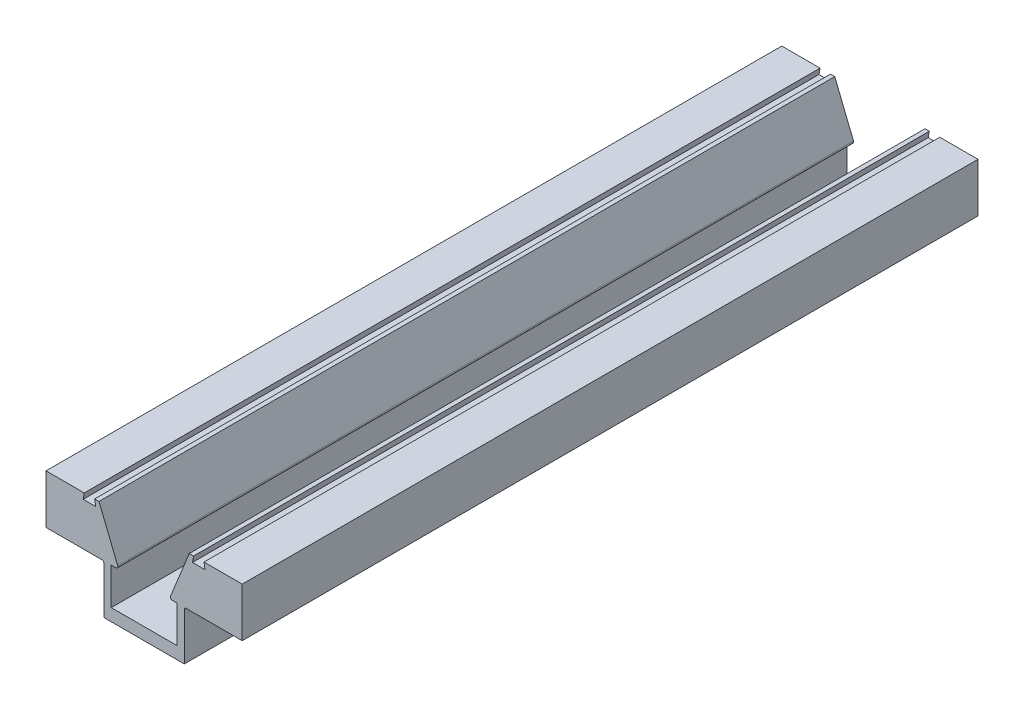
ISO-10303-21;
HEADER;
FILE_DESCRIPTION(('STEP AP214'),'2;1');
FILE_NAME('part.step','',(''),(''),'','','');
FILE_SCHEMA(('AUTOMOTIVE_DESIGN { 1 0 10303 214 1 1 1 1 }'));
ENDSEC;
DATA;
#1=APPLICATION_CONTEXT('core data for automotive mechanical design processes');
#2=APPLICATION_PROTOCOL_DEFINITION('international standard','automotive_design',2000,#1);
#3=PRODUCT_CONTEXT('',#1,'mechanical');
#4=PRODUCT('Part','Part','',(#3));
#5=PRODUCT_RELATED_PRODUCT_CATEGORY('part','',(#4));
#6=PRODUCT_DEFINITION_FORMATION('','',#4);
#7=PRODUCT_DEFINITION_CONTEXT('part definition',#1,'design');
#8=PRODUCT_DEFINITION('design','',#6,#7);
#9=PRODUCT_DEFINITION_SHAPE('','',#8);
#10=(LENGTH_UNIT() NAMED_UNIT(*) SI_UNIT(.MILLI.,.METRE.));
#11=(NAMED_UNIT(*) PLANE_ANGLE_UNIT() SI_UNIT($,.RADIAN.));
#12=(NAMED_UNIT(*) SI_UNIT($,.STERADIAN.) SOLID_ANGLE_UNIT());
#13=UNCERTAINTY_MEASURE_WITH_UNIT(LENGTH_MEASURE(1.E-05),#10,'distance_accuracy_value','');
#14=(GEOMETRIC_REPRESENTATION_CONTEXT(3) GLOBAL_UNCERTAINTY_ASSIGNED_CONTEXT((#13)) GLOBAL_UNIT_ASSIGNED_CONTEXT((#10,
#11,#12)) REPRESENTATION_CONTEXT('',''));
#15=CARTESIAN_POINT('',(0.,0.,0.));
#16=DIRECTION('',(0.,0.,1.));
#17=DIRECTION('',(1.,0.,0.));
#18=AXIS2_PLACEMENT_3D('',#15,#16,#17);
#19=CARTESIAN_POINT('',(7.3060078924,-12.7,190.5));
#20=CARTESIAN_POINT('',(7.2386429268,-12.7,190.5));
#21=CARTESIAN_POINT('',(7.17384187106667,-12.6871102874,190.5));
#22=CARTESIAN_POINT('',(7.1116047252,-12.6613308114,190.5));
#23=CARTESIAN_POINT('',(7.04936757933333,-12.6355513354,190.5));
#24=CARTESIAN_POINT('',(6.99443184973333,-12.5988445,190.5));
#25=CARTESIAN_POINT('',(6.946797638,-12.5512102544,190.5));
#26=CARTESIAN_POINT('',(6.89916342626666,-12.5035760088,190.5));
#27=CARTESIAN_POINT('',(6.8624565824,-12.4486403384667,190.5));
#28=CARTESIAN_POINT('',(6.8366771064,-12.3864031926,190.5));
#29=CARTESIAN_POINT('',(6.8108976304,-12.3241660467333,190.5));
#30=CARTESIAN_POINT('',(6.7980078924,-12.2593649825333,190.5));
#31=CARTESIAN_POINT('',(6.7980078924,-12.192,190.5));
#32=CARTESIAN_POINT('',(7.3060078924,-12.7,0.));
#33=CARTESIAN_POINT('',(7.2386429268,-12.7,0.));
#34=CARTESIAN_POINT('',(7.17384187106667,-12.6871102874,0.));
#35=CARTESIAN_POINT('',(7.1116047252,-12.6613308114,0.));
#36=CARTESIAN_POINT('',(7.04936757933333,-12.6355513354,0.));
#37=CARTESIAN_POINT('',(6.99443184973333,-12.5988445,0.));
#38=CARTESIAN_POINT('',(6.946797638,-12.5512102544,0.));
#39=CARTESIAN_POINT('',(6.89916342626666,-12.5035760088,0.));
#40=CARTESIAN_POINT('',(6.8624565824,-12.4486403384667,0.));
#41=CARTESIAN_POINT('',(6.8366771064,-12.3864031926,0.));
#42=CARTESIAN_POINT('',(6.8108976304,-12.3241660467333,0.));
#43=CARTESIAN_POINT('',(6.7980078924,-12.2593649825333,0.));
#44=CARTESIAN_POINT('',(6.7980078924,-12.192,0.));
#45=B_SPLINE_SURFACE_WITH_KNOTS('',1,3,((#19,#20,#21,#22,#23,#24,#25,#26,#27,#28,#29,#30,#31),
(#32,#33,#34,#35,#36,#37,#38,#39,#40,#41,#42,#43,#44)),.UNSPECIFIED.,.F.,.F.,.F.,(2,2),(4,3,3,3,
4),(0.,1.),(0.,0.25,0.5,0.75,1.),.UNSPECIFIED.);
#46=DIRECTION('',(0.,0.,1.));
#47=VECTOR('',#46,1.);
#48=CARTESIAN_POINT('',(7.3060078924,-12.7,95.25));
#49=LINE('',#48,#47);
#50=CARTESIAN_POINT('',(7.3060078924,-12.7,0.));
#51=VERTEX_POINT('',#50);
#52=CARTESIAN_POINT('',(7.3060078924,-12.7,190.5));
#53=VERTEX_POINT('',#52);
#54=EDGE_CURVE('E557',#51,#53,#49,.T.);
#55=CARTESIAN_POINT('',(6.7980078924,-12.192,190.5));
#56=CARTESIAN_POINT('',(6.79800174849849,-12.2063247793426,190.5));
#57=CARTESIAN_POINT('',(6.79859033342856,-12.2206521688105,190.5));
#58=CARTESIAN_POINT('',(6.80097229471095,-12.2492006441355,190.5));
#59=CARTESIAN_POINT('',(6.80276521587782,-12.2634217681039,190.5));
#60=CARTESIAN_POINT('',(6.80756972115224,-12.2916487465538,190.5));
#61=CARTESIAN_POINT('',(6.81058057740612,-12.3056547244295,190.5));
#62=CARTESIAN_POINT('',(6.81779432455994,-12.3333571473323,190.5));
#63=CARTESIAN_POINT('',(6.82199735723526,-12.3470535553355,190.5));
#64=CARTESIAN_POINT('',(6.83152741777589,-12.3740496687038,190.5));
#65=CARTESIAN_POINT('',(6.8368545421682,-12.3873493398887,190.5));
#66=CARTESIAN_POINT('',(6.84858120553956,-12.4134669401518,190.5));
#67=CARTESIAN_POINT('',(6.85498067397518,-12.4262849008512,190.5));
#68=CARTESIAN_POINT('',(6.86885252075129,-12.4513261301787,190.5));
#69=CARTESIAN_POINT('',(6.87632479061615,-12.4635494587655,190.5));
#70=CARTESIAN_POINT('',(6.89229400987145,-12.4873067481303,190.5));
#71=CARTESIAN_POINT('',(6.90079094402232,-12.4988407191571,190.5));
#72=CARTESIAN_POINT('',(6.91871698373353,-12.5211124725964,190.5));
#73=CARTESIAN_POINT('',(6.92814371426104,-12.5318521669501,190.5));
#74=CARTESIAN_POINT('',(6.9478374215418,-12.5525265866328,190.5));
#75=CARTESIAN_POINT('',(6.9581044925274,-12.5624612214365,190.5));
#76=CARTESIAN_POINT('',(6.99010779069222,-12.5909255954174,190.5));
#77=CARTESIAN_POINT('',(7.0130583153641,-12.6081309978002,190.5));
#78=CARTESIAN_POINT('',(7.0616247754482,-12.6383640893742,190.5));
#79=CARTESIAN_POINT('',(7.08724807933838,-12.6513798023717,190.5));
#80=CARTESIAN_POINT('',(7.14027014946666,-12.6730554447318,190.5));
#81=CARTESIAN_POINT('',(7.16766775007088,-12.6817182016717,190.5));
#82=CARTESIAN_POINT('',(7.21371216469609,-12.6919946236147,190.5));
#83=CARTESIAN_POINT('',(7.23205395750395,-12.6950153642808,190.5));
#84=CARTESIAN_POINT('',(7.26893343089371,-12.6990236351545,190.5));
#85=CARTESIAN_POINT('',(7.28747080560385,-12.7000139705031,190.5));
#86=CARTESIAN_POINT('',(7.3060078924,-12.7,190.5));
#87=B_SPLINE_CURVE_WITH_KNOTS('',3,(#55,#56,#57,#58,#59,#60,#61,#62,#63,#64,#65,#66,#67,#68,#69,
#70,#71,#72,#73,#74,#75,#76,#77,#78,#79,#80,#81,#82,#83,#84,#85,#86),.UNSPECIFIED.,.F.,.F.,(4,2,
2,2,2,2,2,2,2,2,2,2,2,2,2,4),(0.,0.0429657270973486,0.0859152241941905,0.128839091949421,
0.171768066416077,0.214700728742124,0.25763056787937,0.300556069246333,0.343480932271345,
0.386298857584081,0.429121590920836,0.514709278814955,0.600539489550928,0.686313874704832,
0.741972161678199,0.797553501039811),.UNSPECIFIED.);
#88=CARTESIAN_POINT('',(6.7980078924,-12.192,190.5));
#89=VERTEX_POINT('',#88);
#90=EDGE_CURVE('E18',#89,#53,#87,.T.);
#91=DIRECTION('',(0.,0.,-1.));
#92=VECTOR('',#91,1.);
#93=CARTESIAN_POINT('',(6.7980078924,-12.192,95.25));
#94=LINE('',#93,#92);
#95=CARTESIAN_POINT('',(6.7980078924,-12.192,0.));
#96=VERTEX_POINT('',#95);
#97=EDGE_CURVE('E569',#89,#96,#94,.T.);
#98=CARTESIAN_POINT('',(7.3060078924,-12.7,0.));
#99=CARTESIAN_POINT('',(7.29168311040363,-12.7000061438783,0.));
#100=CARTESIAN_POINT('',(7.27735571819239,-12.6994175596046,0.));
#101=CARTESIAN_POINT('',(7.24880723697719,-12.6970356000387,0.));
#102=CARTESIAN_POINT('',(7.23458610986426,-12.6952426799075,0.));
#103=CARTESIAN_POINT('',(7.2063591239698,-12.6904381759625,0.));
#104=CARTESIAN_POINT('',(7.19235314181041,-12.6874273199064,0.));
#105=CARTESIAN_POINT('',(7.16465071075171,-12.6802135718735,0.));
#106=CARTESIAN_POINT('',(7.15095429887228,-12.6760105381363,0.));
#107=CARTESIAN_POINT('',(7.12395817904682,-12.6664804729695,0.));
#108=CARTESIAN_POINT('',(7.11065850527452,-12.6611533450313,0.));
#109=CARTESIAN_POINT('',(7.08454089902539,-12.6494266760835,0.));
#110=CARTESIAN_POINT('',(7.07172293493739,-12.643027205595,0.));
#111=CARTESIAN_POINT('',(7.04668169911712,-12.6291553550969,0.));
#112=CARTESIAN_POINT('',(7.03445836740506,-12.6216830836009,0.));
#113=CARTESIAN_POINT('',(7.01070107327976,-12.605713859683,0.));
#114=CARTESIAN_POINT('',(6.99916710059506,-12.5972169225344,0.));
#115=CARTESIAN_POINT('',(6.97689535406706,-12.5792908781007,0.));
#116=CARTESIAN_POINT('',(6.96615566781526,-12.5698641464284,0.));
#117=CARTESIAN_POINT('',(6.94548126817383,-12.5501704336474,0.));
#118=CARTESIAN_POINT('',(6.93554664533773,-12.5399033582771,0.));
#119=CARTESIAN_POINT('',(6.9070822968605,-12.5079000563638,0.));
#120=CARTESIAN_POINT('',(6.88987689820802,-12.4849495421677,0.));
#121=CARTESIAN_POINT('',(6.85964379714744,-12.4363830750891,0.));
#122=CARTESIAN_POINT('',(6.84662807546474,-12.4107597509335,0.));
#123=CARTESIAN_POINT('',(6.82495242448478,-12.3577376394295,0.));
#124=CARTESIAN_POINT('',(6.81628966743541,-12.3303400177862,0.));
#125=CARTESIAN_POINT('',(6.80601325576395,-12.2842956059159,0.));
#126=CARTESIAN_POINT('',(6.80299252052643,-12.2659538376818,0.));
#127=CARTESIAN_POINT('',(6.7989842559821,-12.22907441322,0.));
#128=CARTESIAN_POINT('',(6.79799392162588,-12.210537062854,0.));
#129=CARTESIAN_POINT('',(6.7980078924,-12.192,0.));
#130=B_SPLINE_CURVE_WITH_KNOTS('',3,(#98,#99,#100,#101,#102,#103,#104,#105,#106,#107,#108,#109,
#110,#111,#112,#113,#114,#115,#116,#117,#118,#119,#120,#121,#122,#123,#124,#125,#126,#127,#128,
#129),.UNSPECIFIED.,.F.,.F.,(4,2,2,2,2,2,2,2,2,2,2,2,2,2,2,4),(0.,0.0429657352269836,
0.0859152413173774,0.128839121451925,0.171768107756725,0.214700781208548,0.25763063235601,
0.300556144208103,0.343481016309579,0.386298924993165,0.429121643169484,0.514709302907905,
0.600539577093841,0.686314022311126,0.741972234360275,0.797553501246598),.UNSPECIFIED.);
#131=EDGE_CURVE('E369',#51,#96,#130,.T.);
#132=ORIENTED_EDGE('',*,*,#54,.T.);
#133=ORIENTED_EDGE('',*,*,#90,.F.);
#134=ORIENTED_EDGE('',*,*,#97,.T.);
#135=ORIENTED_EDGE('',*,*,#131,.F.);
#136=EDGE_LOOP('',(#132,#133,#134,#135));
#137=FACE_BOUND('',#136,.T.);
#138=ADVANCED_FACE('F14',(#137),#45,.F.);
#139=CARTESIAN_POINT('',(10.922,-12.7,190.5));
#140=CARTESIAN_POINT('',(10.8546350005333,-12.7,190.5));
#141=CARTESIAN_POINT('',(10.7898339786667,-12.7128897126,190.5));
#142=CARTESIAN_POINT('',(10.7275968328,-12.7386691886,190.5));
#143=CARTESIAN_POINT('',(10.6653596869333,-12.7644486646,190.5));
#144=CARTESIAN_POINT('',(10.6104239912,-12.8011555,190.5));
#145=CARTESIAN_POINT('',(10.5627897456,-12.8487897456,190.5));
#146=CARTESIAN_POINT('',(10.5151555,-12.8964239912,190.5));
#147=CARTESIAN_POINT('',(10.47844869,-12.9513596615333,190.5));
#148=CARTESIAN_POINT('',(10.452669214,-13.0135968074,190.5));
#149=CARTESIAN_POINT('',(10.426889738,-13.0758339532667,190.5));
#150=CARTESIAN_POINT('',(10.414,-13.1406350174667,190.5));
#151=CARTESIAN_POINT('',(10.414,-13.208,190.5));
#152=CARTESIAN_POINT('',(10.922,-12.7,0.));
#153=CARTESIAN_POINT('',(10.8546350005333,-12.7,0.));
#154=CARTESIAN_POINT('',(10.7898339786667,-12.7128897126,0.));
#155=CARTESIAN_POINT('',(10.7275968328,-12.7386691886,0.));
#156=CARTESIAN_POINT('',(10.6653596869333,-12.7644486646,0.));
#157=CARTESIAN_POINT('',(10.6104239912,-12.8011555,0.));
#158=CARTESIAN_POINT('',(10.5627897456,-12.8487897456,0.));
#159=CARTESIAN_POINT('',(10.5151555,-12.8964239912,0.));
#160=CARTESIAN_POINT('',(10.47844869,-12.9513596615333,0.));
#161=CARTESIAN_POINT('',(10.452669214,-13.0135968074,0.));
#162=CARTESIAN_POINT('',(10.426889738,-13.0758339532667,0.));
#163=CARTESIAN_POINT('',(10.414,-13.1406350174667,0.));
#164=CARTESIAN_POINT('',(10.414,-13.208,0.));
#165=B_SPLINE_SURFACE_WITH_KNOTS('',1,3,((#139,#140,#141,#142,#143,#144,#145,#146,#147,#148,
#149,#150,#151),(#152,#153,#154,#155,#156,#157,#158,#159,#160,#161,#162,#163,#164)),
.UNSPECIFIED.,.F.,.F.,.F.,(2,2),(4,3,3,3,4),(0.,1.),(0.,0.25,0.5,0.75,1.),.UNSPECIFIED.);
#166=DIRECTION('',(0.,0.,1.));
#167=VECTOR('',#166,1.);
#168=CARTESIAN_POINT('',(10.922,-12.7,95.25));
#169=LINE('',#168,#167);
#170=CARTESIAN_POINT('',(10.922,-12.7,0.));
#171=VERTEX_POINT('',#170);
#172=CARTESIAN_POINT('',(10.922,-12.7,190.5));
#173=VERTEX_POINT('',#172);
#174=EDGE_CURVE('E574',#171,#173,#169,.T.);
#175=CARTESIAN_POINT('',(10.414,-13.208,190.5));
#176=CARTESIAN_POINT('',(10.4139938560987,-13.1936752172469,190.5));
#177=CARTESIAN_POINT('',(10.4145824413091,-13.1793478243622,190.5));
#178=CARTESIAN_POINT('',(10.4169644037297,-13.1507993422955,190.5));
#179=CARTESIAN_POINT('',(10.4187573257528,-13.1365782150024,190.5));
#180=CARTESIAN_POINT('',(10.423561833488,-13.1083512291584,190.5));
#181=CARTESIAN_POINT('',(10.4265726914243,-13.0943452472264,190.5));
#182=CARTESIAN_POINT('',(10.4337864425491,-13.0666428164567,190.5));
#183=CARTESIAN_POINT('',(10.4379894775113,-13.0529464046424,190.5));
#184=CARTESIAN_POINT('',(10.4475195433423,-13.0259502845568,190.5));
#185=CARTESIAN_POINT('',(10.4528466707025,-13.0126506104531,190.5));
#186=CARTESIAN_POINT('',(10.4645733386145,-12.9865330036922,190.5));
#187=CARTESIAN_POINT('',(10.4709728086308,-12.9737150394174,190.5));
#188=CARTESIAN_POINT('',(10.4848446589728,-12.9486738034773,190.5));
#189=CARTESIAN_POINT('',(10.4923169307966,-12.9364504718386,190.5));
#190=CARTESIAN_POINT('',(10.5082861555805,-12.9126931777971,190.5));
#191=CARTESIAN_POINT('',(10.516783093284,-12.901159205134,190.5));
#192=CARTESIAN_POINT('',(10.5347091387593,-12.8788874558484,190.5));
#193=CARTESIAN_POINT('',(10.5441358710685,-12.8681477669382,190.5));
#194=CARTESIAN_POINT('',(10.5638295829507,-12.8474733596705,190.5));
#195=CARTESIAN_POINT('',(10.5740966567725,-12.8375387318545,190.5));
#196=CARTESIAN_POINT('',(10.606099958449,-12.8090743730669,190.5));
#197=CARTESIAN_POINT('',(10.6290504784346,-12.7918689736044,190.5));
#198=CARTESIAN_POINT('',(10.6776169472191,-12.7616358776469,190.5));
#199=CARTESIAN_POINT('',(10.70324026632,-12.7486201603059,190.5));
#200=CARTESIAN_POINT('',(10.7562623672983,-12.7269445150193,190.5));
#201=CARTESIAN_POINT('',(10.7836599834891,-12.718281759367,190.5));
#202=CARTESIAN_POINT('',(10.8297043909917,-12.7080053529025,190.5));
#203=CARTESIAN_POINT('',(10.8480461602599,-12.7049846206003,190.5));
#204=CARTESIAN_POINT('',(10.8849255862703,-12.7009763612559,190.5));
#205=CARTESIAN_POINT('',(10.9034629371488,-12.6999860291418,190.5));
#206=CARTESIAN_POINT('',(10.922,-12.7,190.5));
#207=B_SPLINE_CURVE_WITH_KNOTS('',3,(#175,#176,#177,#178,#179,#180,#181,#182,#183,#184,#185,
#186,#187,#188,#189,#190,#191,#192,#193,#194,#195,#196,#197,#198,#199,#200,#201,#202,#203,#204,
#205,#206),.UNSPECIFIED.,.F.,.F.,(4,2,2,2,2,2,2,2,2,2,2,2,2,2,2,4),(0.,0.0429657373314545,
0.0859152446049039,0.128839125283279,0.171768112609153,0.214700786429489,0.257630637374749,
0.300556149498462,0.343481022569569,0.386298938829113,0.429121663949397,0.514709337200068,
0.600539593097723,0.686314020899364,0.741972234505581,0.797553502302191),.UNSPECIFIED.);
#208=CARTESIAN_POINT('',(10.414,-13.208,190.5));
#209=VERTEX_POINT('',#208);
#210=EDGE_CURVE('E363',#209,#173,#207,.T.);
#211=DIRECTION('',(0.,0.,-1.));
#212=VECTOR('',#211,1.);
#213=CARTESIAN_POINT('',(10.414,-13.208,95.25));
#214=LINE('',#213,#212);
#215=CARTESIAN_POINT('',(10.414,-13.208,0.));
#216=VERTEX_POINT('',#215);
#217=EDGE_CURVE('E284',#209,#216,#214,.T.);
#218=CARTESIAN_POINT('',(10.922,-12.7,0.));
#219=CARTESIAN_POINT('',(10.9076752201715,-12.6999938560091,0.));
#220=CARTESIAN_POINT('',(10.8933478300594,-12.7005824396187,0.));
#221=CARTESIAN_POINT('',(10.8647993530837,-12.7029643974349,0.));
#222=CARTESIAN_POINT('',(10.8505782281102,-12.7047573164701,0.));
#223=CARTESIAN_POINT('',(10.8223512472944,-12.7095618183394,0.));
#224=CARTESIAN_POINT('',(10.808345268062,-12.7125726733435,0.));
#225=CARTESIAN_POINT('',(10.780642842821,-12.7197864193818,0.));
#226=CARTESIAN_POINT('',(10.7669464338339,-12.7239894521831,0.));
#227=CARTESIAN_POINT('',(10.7399503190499,-12.7335195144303,0.));
#228=CARTESIAN_POINT('',(10.7266506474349,-12.738846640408,0.));
#229=CARTESIAN_POINT('',(10.7005330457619,-12.7505733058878,0.));
#230=CARTESIAN_POINT('',(10.6877150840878,-12.7569727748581,0.));
#231=CARTESIAN_POINT('',(10.6626738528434,-12.7708446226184,0.));
#232=CARTESIAN_POINT('',(10.6504505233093,-12.7783168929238,0.));
#233=CARTESIAN_POINT('',(10.6266932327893,-12.7942861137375,0.));
#234=CARTESIAN_POINT('',(10.615159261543,-12.8027830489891,0.));
#235=CARTESIAN_POINT('',(10.5928875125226,-12.8207090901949,0.));
#236=CARTESIAN_POINT('',(10.5821478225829,-12.8301358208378,0.));
#237=CARTESIAN_POINT('',(10.5614734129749,-12.8498295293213,0.));
#238=CARTESIAN_POINT('',(10.5515387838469,-12.8600966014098,0.));
#239=CARTESIAN_POINT('',(10.5230744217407,-12.8920998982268,0.));
#240=CARTESIAN_POINT('',(10.5058690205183,-12.9150504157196,0.));
#241=CARTESIAN_POINT('',(10.4756359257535,-12.9636168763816,0.));
#242=CARTESIAN_POINT('',(10.4626202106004,-12.9892401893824,0.));
#243=CARTESIAN_POINT('',(10.4409445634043,-13.0422622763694,0.));
#244=CARTESIAN_POINT('',(10.4322818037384,-13.0696598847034,0.));
#245=CARTESIAN_POINT('',(10.4220053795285,-13.1157043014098,0.));
#246=CARTESIAN_POINT('',(10.418984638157,-13.1340460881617,0.));
#247=CARTESIAN_POINT('',(10.4149763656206,-13.1709255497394,0.));
#248=CARTESIAN_POINT('',(10.4139860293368,-13.1894629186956,0.));
#249=CARTESIAN_POINT('',(10.414,-13.208,0.));
#250=B_SPLINE_CURVE_WITH_KNOTS('',3,(#218,#219,#220,#221,#222,#223,#224,#225,#226,#227,#228,
#229,#230,#231,#232,#233,#234,#235,#236,#237,#238,#239,#240,#241,#242,#243,#244,#245,#246,#247,
#248,#249),.UNSPECIFIED.,.F.,.F.,(4,2,2,2,2,2,2,2,2,2,2,2,2,2,2,4),(0.,0.0429657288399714,
0.0859152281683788,0.128839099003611,0.171768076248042,0.214700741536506,0.257630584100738,
0.300556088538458,0.34348095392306,0.386298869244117,0.429121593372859,0.514709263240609,
0.600539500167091,0.686313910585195,0.741972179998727,0.797553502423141),.UNSPECIFIED.);
#251=EDGE_CURVE('E368',#171,#216,#250,.T.);
#252=ORIENTED_EDGE('',*,*,#174,.T.);
#253=ORIENTED_EDGE('',*,*,#210,.F.);
#254=ORIENTED_EDGE('',*,*,#217,.T.);
#255=ORIENTED_EDGE('',*,*,#251,.F.);
#256=EDGE_LOOP('',(#252,#253,#254,#255));
#257=FACE_BOUND('',#256,.T.);
#258=ADVANCED_FACE('F378',(#257),#165,.F.);
#259=CARTESIAN_POINT('',(12.8016,0.,190.5));
#260=DIRECTION('',(-0.984807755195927,0.173648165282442,0.));
#261=DIRECTION('',(0.,0.,-1.));
#262=AXIS2_PLACEMENT_3D('',#259,#260,#261);
#263=PLANE('',#262);
#264=DIRECTION('',(0.,0.,1.));
#265=VECTOR('',#264,1.);
#266=CARTESIAN_POINT('',(12.8016,0.,95.25));
#267=LINE('',#266,#265);
#268=CARTESIAN_POINT('',(12.8016,0.,0.));
#269=VERTEX_POINT('',#268);
#270=CARTESIAN_POINT('',(12.8016,0.,190.5));
#271=VERTEX_POINT('',#270);
#272=EDGE_CURVE('E235',#269,#271,#267,.T.);
#273=ORIENTED_EDGE('',*,*,#272,.T.);
#274=DIRECTION('',(0.173648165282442,0.984807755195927,0.));
#275=VECTOR('',#274,1.);
#276=CARTESIAN_POINT('',(12.6627601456,-0.7874,190.5));
#277=LINE('',#276,#275);
#278=CARTESIAN_POINT('',(12.5239202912,-1.5748,190.5));
#279=VERTEX_POINT('',#278);
#280=EDGE_CURVE('E134',#279,#271,#277,.T.);
#281=ORIENTED_EDGE('',*,*,#280,.F.);
#282=DIRECTION('',(0.,0.,-1.));
#283=VECTOR('',#282,1.);
#284=CARTESIAN_POINT('',(12.5239202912,-1.5748,95.25));
#285=LINE('',#284,#283);
#286=CARTESIAN_POINT('',(12.5239202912,-1.5748,0.));
#287=VERTEX_POINT('',#286);
#288=EDGE_CURVE('E248',#279,#287,#285,.T.);
#289=ORIENTED_EDGE('',*,*,#288,.T.);
#290=DIRECTION('',(-0.173648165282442,-0.984807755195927,0.));
#291=VECTOR('',#290,1.);
#292=CARTESIAN_POINT('',(12.6627601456,-0.7874,0.));
#293=LINE('',#292,#291);
#294=EDGE_CURVE('E223',#269,#287,#293,.T.);
#295=ORIENTED_EDGE('',*,*,#294,.F.);
#296=EDGE_LOOP('',(#273,#281,#289,#295));
#297=FACE_BOUND('',#296,.T.);
#298=ADVANCED_FACE('F383',(#297),#263,.F.);
#299=CARTESIAN_POINT('',(11.684,0.,190.5));
#300=DIRECTION('',(0.,-1.,0.));
#301=DIRECTION('',(0.,0.,-1.));
#302=AXIS2_PLACEMENT_3D('',#299,#300,#301);
#303=PLANE('',#302);
#304=DIRECTION('',(0.,0.,1.));
#305=VECTOR('',#304,1.);
#306=CARTESIAN_POINT('',(11.684,0.,95.25));
#307=LINE('',#306,#305);
#308=CARTESIAN_POINT('',(11.684,0.,0.));
#309=VERTEX_POINT('',#308);
#310=CARTESIAN_POINT('',(11.684,0.,190.5));
#311=VERTEX_POINT('',#310);
#312=EDGE_CURVE('E232',#309,#311,#307,.T.);
#313=ORIENTED_EDGE('',*,*,#312,.T.);
#314=DIRECTION('',(-1.,0.,0.));
#315=VECTOR('',#314,1.);
#316=CARTESIAN_POINT('',(12.2428,0.,190.5));
#317=LINE('',#316,#315);
#318=EDGE_CURVE('E238',#271,#311,#317,.T.);
#319=ORIENTED_EDGE('',*,*,#318,.F.);
#320=ORIENTED_EDGE('',*,*,#272,.F.);
#321=DIRECTION('',(1.,0.,0.));
#322=VECTOR('',#321,1.);
#323=CARTESIAN_POINT('',(12.2428,0.,0.));
#324=LINE('',#323,#322);
#325=EDGE_CURVE('E229',#309,#269,#324,.T.);
#326=ORIENTED_EDGE('',*,*,#325,.F.);
#327=EDGE_LOOP('',(#313,#319,#320,#326));
#328=FACE_BOUND('',#327,.T.);
#329=ADVANCED_FACE('F231',(#328),#303,.F.);
#330=CARTESIAN_POINT('',(6.7980078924,-12.192,190.5));
#331=CARTESIAN_POINT('',(6.7980078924,-12.1261698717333,190.5));
#332=CARTESIAN_POINT('',(6.81033810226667,-12.0627364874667,190.5));
#333=CARTESIAN_POINT('',(6.834998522,-12.0016998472,190.5));
#334=CARTESIAN_POINT('',(6.7980078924,-12.192,0.));
#335=CARTESIAN_POINT('',(6.7980078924,-12.1261698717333,0.));
#336=CARTESIAN_POINT('',(6.81033810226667,-12.0627364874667,0.));
#337=CARTESIAN_POINT('',(6.834998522,-12.0016998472,0.));
#338=B_SPLINE_SURFACE_WITH_KNOTS('',1,3,((#330,#331,#332,#333),(#334,#335,#336,#337)),
.UNSPECIFIED.,.F.,.F.,.F.,(2,2),(4,4),(0.,1.),(0.,1.),.UNSPECIFIED.);
#339=CARTESIAN_POINT('',(6.834998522,-12.0016998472,190.5));
#340=CARTESIAN_POINT('',(6.82881539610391,-12.0169762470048,190.5));
#341=CARTESIAN_POINT('',(6.82336578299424,-12.0325539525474,190.5));
#342=CARTESIAN_POINT('',(6.81400727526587,-12.0641663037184,190.5));
#343=CARTESIAN_POINT('',(6.81009849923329,-12.0802009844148,190.5));
#344=CARTESIAN_POINT('',(6.80398372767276,-12.1121229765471,190.5));
#345=CARTESIAN_POINT('',(6.80173284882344,-12.1280017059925,190.5));
#346=CARTESIAN_POINT('',(6.79873953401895,-12.1599214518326,190.5));
#347=CARTESIAN_POINT('',(6.79799900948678,-12.1759626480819,190.5));
#348=CARTESIAN_POINT('',(6.7980078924,-12.192,190.5));
#349=B_SPLINE_CURVE_WITH_KNOTS('',3,(#339,#340,#341,#342,#343,#344,#345,#346,#347,#348),
.UNSPECIFIED.,.F.,.F.,(4,2,2,2,4),(0.,0.0494287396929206,0.098861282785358,0.146900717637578,
0.195000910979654),.UNSPECIFIED.);
#350=CARTESIAN_POINT('',(6.834998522,-12.0016998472,190.5));
#351=VERTEX_POINT('',#350);
#352=EDGE_CURVE('E237',#351,#89,#349,.T.);
#353=DIRECTION('',(0.,0.,-1.));
#354=VECTOR('',#353,1.);
#355=CARTESIAN_POINT('',(6.834998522,-12.0016998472,95.25));
#356=LINE('',#355,#354);
#357=CARTESIAN_POINT('',(6.834998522,-12.0016998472,0.));
#358=VERTEX_POINT('',#357);
#359=EDGE_CURVE('E247',#351,#358,#356,.T.);
#360=CARTESIAN_POINT('',(6.7980078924,-12.192,0.));
#361=CARTESIAN_POINT('',(6.79799764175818,-12.1755197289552,0.));
#362=CARTESIAN_POINT('',(6.7987803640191,-12.1590348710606,0.));
#363=CARTESIAN_POINT('',(6.80194551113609,-12.1262186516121,0.));
#364=CARTESIAN_POINT('',(6.80432805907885,-12.1098873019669,0.));
#365=CARTESIAN_POINT('',(6.81061673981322,-12.0779991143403,0.));
#366=CARTESIAN_POINT('',(6.81447804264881,-12.0624334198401,0.));
#367=CARTESIAN_POINT('',(6.8236600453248,-12.0317166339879,0.));
#368=CARTESIAN_POINT('',(6.82898258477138,-12.0165660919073,0.));
#369=CARTESIAN_POINT('',(6.834998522,-12.0016998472,0.));
#370=B_SPLINE_CURVE_WITH_KNOTS('',3,(#360,#361,#362,#363,#364,#365,#366,#367,#368,#369),
.UNSPECIFIED.,.F.,.F.,(4,2,2,2,4),(0.,0.0494287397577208,0.0988612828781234,0.14690071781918,
0.195000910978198),.UNSPECIFIED.);
#371=EDGE_CURVE('E253',#96,#358,#370,.T.);
#372=ORIENTED_EDGE('',*,*,#97,.F.);
#373=ORIENTED_EDGE('',*,*,#352,.F.);
#374=ORIENTED_EDGE('',*,*,#359,.T.);
#375=ORIENTED_EDGE('',*,*,#371,.F.);
#376=EDGE_LOOP('',(#372,#373,#374,#375));
#377=FACE_BOUND('',#376,.T.);
#378=ADVANCED_FACE('F317',(#377),#338,.F.);
#379=CARTESIAN_POINT('',(8.509,-12.7,190.5));
#380=DIRECTION('',(0.,1.,0.));
#381=DIRECTION('',(0.,0.,-1.));
#382=AXIS2_PLACEMENT_3D('',#379,#380,#381);
#383=PLANE('',#382);
#384=DIRECTION('',(0.,0.,1.));
#385=VECTOR('',#384,1.);
#386=CARTESIAN_POINT('',(8.509,-12.7,95.25));
#387=LINE('',#386,#385);
#388=CARTESIAN_POINT('',(8.509,-12.7,0.));
#389=VERTEX_POINT('',#388);
#390=CARTESIAN_POINT('',(8.509,-12.7,190.5));
#391=VERTEX_POINT('',#390);
#392=EDGE_CURVE('E562',#389,#391,#387,.T.);
#393=ORIENTED_EDGE('',*,*,#392,.T.);
#394=DIRECTION('',(1.,0.,0.));
#395=VECTOR('',#394,1.);
#396=CARTESIAN_POINT('',(7.9075039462,-12.7,190.5));
#397=LINE('',#396,#395);
#398=EDGE_CURVE('E559',#53,#391,#397,.T.);
#399=ORIENTED_EDGE('',*,*,#398,.F.);
#400=ORIENTED_EDGE('',*,*,#54,.F.);
#401=DIRECTION('',(-1.,0.,0.));
#402=VECTOR('',#401,1.);
#403=CARTESIAN_POINT('',(7.9075039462,-12.7,0.));
#404=LINE('',#403,#402);
#405=EDGE_CURVE('E545',#389,#51,#404,.T.);
#406=ORIENTED_EDGE('',*,*,#405,.F.);
#407=EDGE_LOOP('',(#393,#399,#400,#406));
#408=FACE_BOUND('',#407,.T.);
#409=ADVANCED_FACE('F407',(#408),#383,.F.);
#410=CARTESIAN_POINT('',(-7.3060078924,-12.7,190.5));
#411=DIRECTION('',(0.,1.,0.));
#412=DIRECTION('',(0.,0.,-1.));
#413=AXIS2_PLACEMENT_3D('',#410,#411,#412);
#414=PLANE('',#413);
#415=DIRECTION('',(0.,0.,1.));
#416=VECTOR('',#415,1.);
#417=CARTESIAN_POINT('',(-7.3060078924,-12.7,95.25));
#418=LINE('',#417,#416);
#419=CARTESIAN_POINT('',(-7.3060078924,-12.7,0.));
#420=VERTEX_POINT('',#419);
#421=CARTESIAN_POINT('',(-7.3060078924,-12.7,190.5));
#422=VERTEX_POINT('',#421);
#423=EDGE_CURVE('E340',#420,#422,#418,.T.);
#424=ORIENTED_EDGE('',*,*,#423,.T.);
#425=DIRECTION('',(1.,0.,0.));
#426=VECTOR('',#425,1.);
#427=CARTESIAN_POINT('',(-7.9075039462,-12.7,190.5));
#428=LINE('',#427,#426);
#429=CARTESIAN_POINT('',(-8.509,-12.7,190.5));
#430=VERTEX_POINT('',#429);
#431=EDGE_CURVE('E543',#430,#422,#428,.T.);
#432=ORIENTED_EDGE('',*,*,#431,.F.);
#433=DIRECTION('',(0.,0.,-1.));
#434=VECTOR('',#433,1.);
#435=CARTESIAN_POINT('',(-8.509,-12.7,95.25));
#436=LINE('',#435,#434);
#437=CARTESIAN_POINT('',(-8.509,-12.7,0.));
#438=VERTEX_POINT('',#437);
#439=EDGE_CURVE('E546',#430,#438,#436,.T.);
#440=ORIENTED_EDGE('',*,*,#439,.T.);
#441=DIRECTION('',(-1.,0.,0.));
#442=VECTOR('',#441,1.);
#443=CARTESIAN_POINT('',(-7.9075039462,-12.7,0.));
#444=LINE('',#443,#442);
#445=EDGE_CURVE('E541',#420,#438,#444,.T.);
#446=ORIENTED_EDGE('',*,*,#445,.F.);
#447=EDGE_LOOP('',(#424,#432,#440,#446));
#448=FACE_BOUND('',#447,.T.);
#449=ADVANCED_FACE('F315',(#448),#414,.F.);
#450=CARTESIAN_POINT('',(-6.834998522,-12.0016998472,190.5));
#451=CARTESIAN_POINT('',(-6.81942124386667,-12.0402549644,190.5));
#452=CARTESIAN_POINT('',(-6.80873901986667,-12.0801217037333,190.5));
#453=CARTESIAN_POINT('',(-6.8029517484,-12.1213000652,190.5));
#454=CARTESIAN_POINT('',(-6.79716447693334,-12.1624784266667,190.5));
#455=CARTESIAN_POINT('',(-6.79644414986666,-12.2037452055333,190.5));
#456=CARTESIAN_POINT('',(-6.8007907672,-12.2451004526,190.5));
#457=CARTESIAN_POINT('',(-6.80513738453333,-12.2864556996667,190.5));
#458=CARTESIAN_POINT('',(-6.81442181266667,-12.3266709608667,190.5));
#459=CARTESIAN_POINT('',(-6.8286440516,-12.3657462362,190.5));
#460=CARTESIAN_POINT('',(-6.84286629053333,-12.4048215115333,190.5));
#461=CARTESIAN_POINT('',(-6.86160392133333,-12.4415960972,190.5));
#462=CARTESIAN_POINT('',(-6.8848568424,-12.4760699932,190.5));
#463=CARTESIAN_POINT('',(-6.90810976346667,-12.5105438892,190.5));
#464=CARTESIAN_POINT('',(-6.93518733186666,-12.541693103,190.5));
#465=CARTESIAN_POINT('',(-6.9660895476,-12.5695175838,190.5));
#466=CARTESIAN_POINT('',(-6.99699176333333,-12.5973420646,190.5));
#467=CARTESIAN_POINT('',(-7.03080073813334,-12.6210153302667,190.5));
#468=CARTESIAN_POINT('',(-7.0675163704,-12.6405373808,190.5));
#469=CARTESIAN_POINT('',(-7.10423200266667,-12.6600594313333,190.5));
#470=CARTESIAN_POINT('',(-7.14276370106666,-12.6748504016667,190.5));
#471=CARTESIAN_POINT('',(-7.1831115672,-12.684910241,190.5));
#472=CARTESIAN_POINT('',(-7.22345943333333,-12.6949700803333,190.5));
#473=CARTESIAN_POINT('',(-7.26442487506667,-12.7,190.5));
#474=CARTESIAN_POINT('',(-7.3060078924,-12.7,190.5));
#475=CARTESIAN_POINT('',(-6.834998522,-12.0016998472,0.));
#476=CARTESIAN_POINT('',(-6.81942124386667,-12.0402549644,0.));
#477=CARTESIAN_POINT('',(-6.80873901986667,-12.0801217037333,0.));
#478=CARTESIAN_POINT('',(-6.8029517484,-12.1213000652,0.));
#479=CARTESIAN_POINT('',(-6.79716447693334,-12.1624784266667,0.));
#480=CARTESIAN_POINT('',(-6.79644414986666,-12.2037452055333,0.));
#481=CARTESIAN_POINT('',(-6.8007907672,-12.2451004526,0.));
#482=CARTESIAN_POINT('',(-6.80513738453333,-12.2864556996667,0.));
#483=CARTESIAN_POINT('',(-6.81442181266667,-12.3266709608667,0.));
#484=CARTESIAN_POINT('',(-6.8286440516,-12.3657462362,0.));
#485=CARTESIAN_POINT('',(-6.84286629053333,-12.4048215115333,0.));
#486=CARTESIAN_POINT('',(-6.86160392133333,-12.4415960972,0.));
#487=CARTESIAN_POINT('',(-6.8848568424,-12.4760699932,0.));
#488=CARTESIAN_POINT('',(-6.90810976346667,-12.5105438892,0.));
#489=CARTESIAN_POINT('',(-6.93518733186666,-12.541693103,0.));
#490=CARTESIAN_POINT('',(-6.9660895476,-12.5695175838,0.));
#491=CARTESIAN_POINT('',(-6.99699176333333,-12.5973420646,0.));
#492=CARTESIAN_POINT('',(-7.03080073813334,-12.6210153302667,0.));
#493=CARTESIAN_POINT('',(-7.0675163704,-12.6405373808,0.));
#494=CARTESIAN_POINT('',(-7.10423200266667,-12.6600594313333,0.));
#495=CARTESIAN_POINT('',(-7.14276370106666,-12.6748504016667,0.));
#496=CARTESIAN_POINT('',(-7.1831115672,-12.684910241,0.));
#497=CARTESIAN_POINT('',(-7.22345943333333,-12.6949700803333,0.));
#498=CARTESIAN_POINT('',(-7.26442487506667,-12.7,0.));
#499=CARTESIAN_POINT('',(-7.3060078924,-12.7,0.));
#500=B_SPLINE_SURFACE_WITH_KNOTS('',1,3,((#450,#451,#452,#453,#454,#455,#456,#457,#458,#459,
#460,#461,#462,#463,#464,#465,#466,#467,#468,#469,#470,#471,#472,#473,#474),(#475,#476,#477,
#478,#479,#480,#481,#482,#483,#484,#485,#486,#487,#488,#489,#490,#491,#492,#493,#494,#495,#496,
#497,#498,#499)),.UNSPECIFIED.,.F.,.F.,.F.,(2,2),(4,3,3,3,3,3,3,3,4),(0.,1.),(0.,0.125,0.25,
0.375,0.5,0.625,0.75,0.875,1.),.UNSPECIFIED.);
#501=DIRECTION('',(0.,0.,1.));
#502=VECTOR('',#501,1.);
#503=CARTESIAN_POINT('',(-6.834998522,-12.0016998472,95.25));
#504=LINE('',#503,#502);
#505=CARTESIAN_POINT('',(-6.834998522,-12.0016998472,0.));
#506=VERTEX_POINT('',#505);
#507=CARTESIAN_POINT('',(-6.83499852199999,-12.0016998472,190.5));
#508=VERTEX_POINT('',#507);
#509=EDGE_CURVE('E549',#506,#508,#504,.T.);
#510=CARTESIAN_POINT('',(-7.3060078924,-12.7,190.5));
#511=CARTESIAN_POINT('',(-7.2774151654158,-12.7000272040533,190.5));
#512=CARTESIAN_POINT('',(-7.24882787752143,-12.6975945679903,190.5));
#513=CARTESIAN_POINT('',(-7.19248258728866,-12.6879830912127,190.5));
#514=CARTESIAN_POINT('',(-7.16472401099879,-12.6808076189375,190.5));
#515=CARTESIAN_POINT('',(-7.11079795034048,-12.6618786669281,190.5));
#516=CARTESIAN_POINT('',(-7.08463128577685,-12.650122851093,190.5));
#517=CARTESIAN_POINT('',(-7.03464416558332,-12.6223967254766,190.5));
#518=CARTESIAN_POINT('',(-7.01082317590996,-12.6064273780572,190.5));
#519=CARTESIAN_POINT('',(-6.96626901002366,-12.5707675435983,190.5));
#520=CARTESIAN_POINT('',(-6.94552670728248,-12.5510884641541,190.5));
#521=CARTESIAN_POINT('',(-6.90760626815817,-12.5084924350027,190.5));
#522=CARTESIAN_POINT('',(-6.89043429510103,-12.4855699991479,190.5));
#523=CARTESIAN_POINT('',(-6.86011511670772,-12.4370811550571,190.5));
#524=CARTESIAN_POINT('',(-6.84698344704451,-12.4115050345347,190.5));
#525=CARTESIAN_POINT('',(-6.82522750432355,-12.3585526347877,190.5));
#526=CARTESIAN_POINT('',(-6.81659558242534,-12.3311794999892,190.5));
#527=CARTESIAN_POINT('',(-6.80407945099,-12.2754344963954,190.5));
#528=CARTESIAN_POINT('',(-6.80018463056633,-12.2470650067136,190.5));
#529=CARTESIAN_POINT('',(-6.797208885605,-12.1900746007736,190.5));
#530=CARTESIAN_POINT('',(-6.79812716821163,-12.1614537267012,190.5));
#531=CARTESIAN_POINT('',(-6.80405691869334,-12.1105846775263,190.5));
#532=CARTESIAN_POINT('',(-6.80819279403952,-12.0882303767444,190.5));
#533=CARTESIAN_POINT('',(-6.81940798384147,-12.0442946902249,190.5));
#534=CARTESIAN_POINT('',(-6.82648467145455,-12.0227126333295,190.5));
#535=CARTESIAN_POINT('',(-6.83499852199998,-12.0016998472,190.5));
#536=B_SPLINE_CURVE_WITH_KNOTS('',3,(#510,#511,#512,#513,#514,#515,#516,#517,#518,#519,#520,
#521,#522,#523,#524,#525,#526,#527,#528,#529,#530,#531,#532,#533,#534,#535),.UNSPECIFIED.,.F.,
.F.,(4,2,2,2,2,2,2,2,2,2,2,2,4),(0.,0.0856668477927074,0.171272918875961,0.256922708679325,
0.342552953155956,0.42792405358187,0.513441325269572,0.599283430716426,0.684979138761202,
0.770482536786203,0.855971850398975,0.92397604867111,0.991919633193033),.UNSPECIFIED.);
#537=EDGE_CURVE('E334',#422,#508,#536,.T.);
#538=CARTESIAN_POINT('',(-6.834998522,-12.0016998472,0.));
#539=CARTESIAN_POINT('',(-6.82426229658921,-12.0282003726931,0.));
#540=CARTESIAN_POINT('',(-6.81580881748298,-12.0556173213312,0.));
#541=CARTESIAN_POINT('',(-6.80361310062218,-12.1114602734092,0.));
#542=CARTESIAN_POINT('',(-6.79986752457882,-12.1398855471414,0.));
#543=CARTESIAN_POINT('',(-6.79721705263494,-12.1969758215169,0.));
#544=CARTESIAN_POINT('',(-6.79831463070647,-12.2256409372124,0.));
#545=CARTESIAN_POINT('',(-6.80529633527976,-12.2823745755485,0.));
#546=CARTESIAN_POINT('',(-6.81117936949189,-12.3104432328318,0.));
#547=CARTESIAN_POINT('',(-6.82755229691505,-12.3651114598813,0.));
#548=CARTESIAN_POINT('',(-6.83802818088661,-12.3917152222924,0.));
#549=CARTESIAN_POINT('',(-6.86331716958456,-12.442831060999,0.));
#550=CARTESIAN_POINT('',(-6.87813766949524,-12.467339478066,0.));
#551=CARTESIAN_POINT('',(-6.91173790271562,-12.5136152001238,0.));
#552=CARTESIAN_POINT('',(-6.93053248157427,-12.5353717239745,0.));
#553=CARTESIAN_POINT('',(-6.97147924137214,-12.5753799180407,0.));
#554=CARTESIAN_POINT('',(-6.99362564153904,-12.5936375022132,0.));
#555=CARTESIAN_POINT('',(-7.04062287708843,-12.6261247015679,0.));
#556=CARTESIAN_POINT('',(-7.06546751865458,-12.6403632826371,0.));
#557=CARTESIAN_POINT('',(-7.11719321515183,-12.6644713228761,0.));
#558=CARTESIAN_POINT('',(-7.14407393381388,-12.6743415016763,0.));
#559=CARTESIAN_POINT('',(-7.19346021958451,-12.6878994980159,0.));
#560=CARTESIAN_POINT('',(-7.21573618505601,-12.6924388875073,0.));
#561=CARTESIAN_POINT('',(-7.26067412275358,-12.6984989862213,0.));
#562=CARTESIAN_POINT('',(-7.28333573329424,-12.7000223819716,0.));
#563=CARTESIAN_POINT('',(-7.30600789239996,-12.7,0.));
#564=B_SPLINE_CURVE_WITH_KNOTS('',3,(#538,#539,#540,#541,#542,#543,#544,#545,#546,#547,#548,
#549,#550,#551,#552,#553,#554,#555,#556,#557,#558,#559,#560,#561,#562,#563),.UNSPECIFIED.,.F.,
.F.,(4,2,2,2,2,2,2,2,2,2,2,2,4),(0.,0.0856668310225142,0.171272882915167,0.256922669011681,
0.342552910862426,0.427923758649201,0.513440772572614,0.599283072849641,0.684978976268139,
0.77048216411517,0.855971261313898,0.923975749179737,0.991919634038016),.UNSPECIFIED.);
#565=EDGE_CURVE('E328',#506,#420,#564,.T.);
#566=ORIENTED_EDGE('',*,*,#509,.T.);
#567=ORIENTED_EDGE('',*,*,#537,.F.);
#568=ORIENTED_EDGE('',*,*,#423,.F.);
#569=ORIENTED_EDGE('',*,*,#565,.F.);
#570=EDGE_LOOP('',(#566,#567,#568,#569));
#571=FACE_BOUND('',#570,.T.);
#572=ADVANCED_FACE('F302',(#571),#500,.F.);
#573=CARTESIAN_POINT('',(-12.8016,0.,190.5));
#574=DIRECTION('',(0.,-1.,0.));
#575=DIRECTION('',(0.,0.,-1.));
#576=AXIS2_PLACEMENT_3D('',#573,#574,#575);
#577=PLANE('',#576);
#578=DIRECTION('',(0.,0.,1.));
#579=VECTOR('',#578,1.);
#580=CARTESIAN_POINT('',(-12.8016,0.,95.25));
#581=LINE('',#580,#579);
#582=CARTESIAN_POINT('',(-12.8016,0.,0.));
#583=VERTEX_POINT('',#582);
#584=CARTESIAN_POINT('',(-12.8016,0.,190.5));
#585=VERTEX_POINT('',#584);
#586=EDGE_CURVE('E520',#583,#585,#581,.T.);
#587=ORIENTED_EDGE('',*,*,#586,.T.);
#588=DIRECTION('',(-1.,0.,0.));
#589=VECTOR('',#588,1.);
#590=CARTESIAN_POINT('',(-12.2428,0.,190.5));
#591=LINE('',#590,#589);
#592=CARTESIAN_POINT('',(-11.684,0.,190.5));
#593=VERTEX_POINT('',#592);
#594=EDGE_CURVE('E518',#593,#585,#591,.T.);
#595=ORIENTED_EDGE('',*,*,#594,.F.);
#596=DIRECTION('',(0.,0.,-1.));
#597=VECTOR('',#596,1.);
#598=CARTESIAN_POINT('',(-11.684,0.,95.25));
#599=LINE('',#598,#597);
#600=CARTESIAN_POINT('',(-11.684,0.,0.));
#601=VERTEX_POINT('',#600);
#602=EDGE_CURVE('E624',#593,#601,#599,.T.);
#603=ORIENTED_EDGE('',*,*,#602,.T.);
#604=DIRECTION('',(1.,0.,0.));
#605=VECTOR('',#604,1.);
#606=CARTESIAN_POINT('',(-12.2428,0.,0.));
#607=LINE('',#606,#605);
#608=EDGE_CURVE('E145',#583,#601,#607,.T.);
#609=ORIENTED_EDGE('',*,*,#608,.F.);
#610=EDGE_LOOP('',(#587,#595,#603,#609));
#611=FACE_BOUND('',#610,.T.);
#612=ADVANCED_FACE('F314',(#611),#577,.F.);
#613=CARTESIAN_POINT('',(-12.5239202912,-1.5748,190.5));
#614=DIRECTION('',(0.984807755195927,0.173648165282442,0.));
#615=DIRECTION('',(0.,0.,-1.));
#616=AXIS2_PLACEMENT_3D('',#613,#614,#615);
#617=PLANE('',#616);
#618=DIRECTION('',(0.,0.,1.));
#619=VECTOR('',#618,1.);
#620=CARTESIAN_POINT('',(-12.5239202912,-1.5748,95.25));
#621=LINE('',#620,#619);
#622=CARTESIAN_POINT('',(-12.5239202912,-1.5748,0.));
#623=VERTEX_POINT('',#622);
#624=CARTESIAN_POINT('',(-12.5239202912,-1.5748,190.5));
#625=VERTEX_POINT('',#624);
#626=EDGE_CURVE('E527',#623,#625,#621,.T.);
#627=ORIENTED_EDGE('',*,*,#626,.T.);
#628=DIRECTION('',(0.173648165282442,-0.984807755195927,0.));
#629=VECTOR('',#628,1.);
#630=CARTESIAN_POINT('',(-12.6627601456,-0.7874,190.5));
#631=LINE('',#630,#629);
#632=EDGE_CURVE('E536',#585,#625,#631,.T.);
#633=ORIENTED_EDGE('',*,*,#632,.F.);
#634=ORIENTED_EDGE('',*,*,#586,.F.);
#635=DIRECTION('',(-0.173648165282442,0.984807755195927,0.));
#636=VECTOR('',#635,1.);
#637=CARTESIAN_POINT('',(-12.6627601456,-0.7874,0.));
#638=LINE('',#637,#636);
#639=EDGE_CURVE('E153',#623,#583,#638,.T.);
#640=ORIENTED_EDGE('',*,*,#639,.F.);
#641=EDGE_LOOP('',(#627,#633,#634,#640));
#642=FACE_BOUND('',#641,.T.);
#643=ADVANCED_FACE('F416',(#642),#617,.F.);
#644=CARTESIAN_POINT('',(-15.4974405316,0.,190.5));
#645=DIRECTION('',(-0.984807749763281,0.17364819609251,0.));
#646=DIRECTION('',(0.,0.,-1.));
#647=AXIS2_PLACEMENT_3D('',#644,#645,#646);
#648=PLANE('',#647);
#649=DIRECTION('',(0.,0.,1.));
#650=VECTOR('',#649,1.);
#651=CARTESIAN_POINT('',(-15.4974405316,0.,95.25));
#652=LINE('',#651,#650);
#653=CARTESIAN_POINT('',(-15.4974405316,0.,0.));
#654=VERTEX_POINT('',#653);
#655=CARTESIAN_POINT('',(-15.4974405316,0.,190.5));
#656=VERTEX_POINT('',#655);
#657=EDGE_CURVE('E526',#654,#656,#652,.T.);
#658=ORIENTED_EDGE('',*,*,#657,.T.);
#659=DIRECTION('',(0.173648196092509,0.984807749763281,0.));
#660=VECTOR('',#659,1.);
#661=CARTESIAN_POINT('',(-15.6362804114,-0.7874,190.5));
#662=LINE('',#661,#660);
#663=CARTESIAN_POINT('',(-15.7751202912,-1.5748,190.5));
#664=VERTEX_POINT('',#663);
#665=EDGE_CURVE('E516',#664,#656,#662,.T.);
#666=ORIENTED_EDGE('',*,*,#665,.F.);
#667=DIRECTION('',(0.,0.,-1.));
#668=VECTOR('',#667,1.);
#669=CARTESIAN_POINT('',(-15.7751202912,-1.5748,95.25));
#670=LINE('',#669,#668);
#671=CARTESIAN_POINT('',(-15.7751202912,-1.5748,0.));
#672=VERTEX_POINT('',#671);
#673=EDGE_CURVE('E523',#664,#672,#670,.T.);
#674=ORIENTED_EDGE('',*,*,#673,.T.);
#675=DIRECTION('',(-0.173648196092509,-0.984807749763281,0.));
#676=VECTOR('',#675,1.);
#677=CARTESIAN_POINT('',(-15.6362804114,-0.7874,0.));
#678=LINE('',#677,#676);
#679=EDGE_CURVE('E514',#654,#672,#678,.T.);
#680=ORIENTED_EDGE('',*,*,#679,.F.);
#681=EDGE_LOOP('',(#658,#666,#674,#680));
#682=FACE_BOUND('',#681,.T.);
#683=ADVANCED_FACE('F300',(#682),#648,.F.);
#684=CARTESIAN_POINT('',(-10.414,-13.208,190.5));
#685=CARTESIAN_POINT('',(-10.414,-13.1406350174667,190.5));
#686=CARTESIAN_POINT('',(-10.4268897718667,-13.0758339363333,190.5));
#687=CARTESIAN_POINT('',(-10.452669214,-13.0135968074,190.5));
#688=CARTESIAN_POINT('',(-10.4784486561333,-12.9513596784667,190.5));
#689=CARTESIAN_POINT('',(-10.5151555,-12.8964239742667,190.5));
#690=CARTESIAN_POINT('',(-10.5627897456,-12.8487897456,190.5));
#691=CARTESIAN_POINT('',(-10.6104239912,-12.8011555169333,190.5));
#692=CARTESIAN_POINT('',(-10.6653597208,-12.7644486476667,190.5));
#693=CARTESIAN_POINT('',(-10.7275968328,-12.7386691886,190.5));
#694=CARTESIAN_POINT('',(-10.7898339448,-12.7128897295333,190.5));
#695=CARTESIAN_POINT('',(-10.8546350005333,-12.7,190.5));
#696=CARTESIAN_POINT('',(-10.922,-12.7,190.5));
#697=CARTESIAN_POINT('',(-10.414,-13.208,0.));
#698=CARTESIAN_POINT('',(-10.414,-13.1406350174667,0.));
#699=CARTESIAN_POINT('',(-10.4268897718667,-13.0758339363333,0.));
#700=CARTESIAN_POINT('',(-10.452669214,-13.0135968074,0.));
#701=CARTESIAN_POINT('',(-10.4784486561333,-12.9513596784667,0.));
#702=CARTESIAN_POINT('',(-10.5151555,-12.8964239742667,0.));
#703=CARTESIAN_POINT('',(-10.5627897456,-12.8487897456,0.));
#704=CARTESIAN_POINT('',(-10.6104239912,-12.8011555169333,0.));
#705=CARTESIAN_POINT('',(-10.6653597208,-12.7644486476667,0.));
#706=CARTESIAN_POINT('',(-10.7275968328,-12.7386691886,0.));
#707=CARTESIAN_POINT('',(-10.7898339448,-12.7128897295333,0.));
#708=CARTESIAN_POINT('',(-10.8546350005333,-12.7,0.));
#709=CARTESIAN_POINT('',(-10.922,-12.7,0.));
#710=B_SPLINE_SURFACE_WITH_KNOTS('',1,3,((#684,#685,#686,#687,#688,#689,#690,#691,#692,#693,
#694,#695,#696),(#697,#698,#699,#700,#701,#702,#703,#704,#705,#706,#707,#708,#709)),
.UNSPECIFIED.,.F.,.F.,.F.,(2,2),(4,3,3,3,4),(0.,1.),(0.,0.25,0.5,0.75,1.),.UNSPECIFIED.);
#711=DIRECTION('',(0.,0.,1.));
#712=VECTOR('',#711,1.);
#713=CARTESIAN_POINT('',(-10.414,-13.208,95.25));
#714=LINE('',#713,#712);
#715=CARTESIAN_POINT('',(-10.414,-13.208,0.));
#716=VERTEX_POINT('',#715);
#717=CARTESIAN_POINT('',(-10.414,-13.208,190.5));
#718=VERTEX_POINT('',#717);
#719=EDGE_CURVE('E599',#716,#718,#714,.T.);
#720=CARTESIAN_POINT('',(-10.922,-12.7,190.5));
#721=CARTESIAN_POINT('',(-10.9076752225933,-12.6999938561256,190.5));
#722=CARTESIAN_POINT('',(-10.8933478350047,-12.7005824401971,190.5));
#723=CARTESIAN_POINT('',(-10.8647993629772,-12.7029643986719,190.5));
#724=CARTESIAN_POINT('',(-10.8505782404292,-12.704757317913,190.5));
#725=CARTESIAN_POINT('',(-10.8223512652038,-12.7095618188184,190.5));
#726=CARTESIAN_POINT('',(-10.8083452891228,-12.7125726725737,190.5));
#727=CARTESIAN_POINT('',(-10.7806428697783,-12.7197864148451,190.5));
#728=CARTESIAN_POINT('',(-10.7669464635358,-12.723989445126,190.5));
#729=CARTESIAN_POINT('',(-10.7399503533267,-12.7335195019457,190.5));
#730=CARTESIAN_POINT('',(-10.7266506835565,-12.7388466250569,190.5));
#731=CARTESIAN_POINT('',(-10.7005330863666,-12.750573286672,190.5));
#732=CARTESIAN_POINT('',(-10.6877151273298,-12.7569727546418,190.5));
#733=CARTESIAN_POINT('',(-10.6626739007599,-12.770844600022,190.5));
#734=CARTESIAN_POINT('',(-10.6504505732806,-12.7783168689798,190.5));
#735=CARTESIAN_POINT('',(-10.6266932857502,-12.7942860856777,190.5));
#736=CARTESIAN_POINT('',(-10.6151593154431,-12.8027830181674,190.5));
#737=CARTESIAN_POINT('',(-10.5928875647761,-12.8207090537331,190.5));
#738=CARTESIAN_POINT('',(-10.5821478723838,-12.8301357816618,190.5));
#739=CARTESIAN_POINT('',(-10.5614734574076,-12.8498294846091,190.5));
#740=CARTESIAN_POINT('',(-10.5515388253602,-12.8600965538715,190.5));
#741=CARTESIAN_POINT('',(-10.5230744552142,-12.892099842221,190.5));
#742=CARTESIAN_POINT('',(-10.5058690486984,-12.9150503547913,190.5));
#743=CARTESIAN_POINT('',(-10.4756359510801,-12.9636168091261,190.5));
#744=CARTESIAN_POINT('',(-10.4626202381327,-12.9892401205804,190.5));
#745=CARTESIAN_POINT('',(-10.4409445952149,-13.0422622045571,190.5));
#746=CARTESIAN_POINT('',(-10.4322818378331,-13.0696598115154,190.5));
#747=CARTESIAN_POINT('',(-10.4220054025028,-13.1157042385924,190.5));
#748=CARTESIAN_POINT('',(-10.4189846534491,-13.134046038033,190.5));
#749=CARTESIAN_POINT('',(-10.4149763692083,-13.1709255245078,190.5));
#750=CARTESIAN_POINT('',(-10.4139860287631,-13.1894629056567,190.5));
#751=CARTESIAN_POINT('',(-10.414,-13.208,190.5));
#752=B_SPLINE_CURVE_WITH_KNOTS('',3,(#720,#721,#722,#723,#724,#725,#726,#727,#728,#729,#730,
#731,#732,#733,#734,#735,#736,#737,#738,#739,#740,#741,#742,#743,#744,#745,#746,#747,#748,#749,
#750,#751),.UNSPECIFIED.,.F.,.F.,(4,2,2,2,2,2,2,2,2,2,2,2,2,2,2,4),(0.,0.04296572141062,
0.0859152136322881,0.128839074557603,0.171768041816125,0.214700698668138,0.257630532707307,
0.300556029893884,0.343480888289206,0.386298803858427,0.429121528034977,0.514709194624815,
0.600539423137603,0.686313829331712,0.741972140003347,0.797553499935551),.UNSPECIFIED.);
#753=CARTESIAN_POINT('',(-10.922,-12.7,190.5));
#754=VERTEX_POINT('',#753);
#755=EDGE_CURVE('E285',#754,#718,#752,.T.);
#756=DIRECTION('',(0.,0.,-1.));
#757=VECTOR('',#756,1.);
#758=CARTESIAN_POINT('',(-10.922,-12.7,95.25));
#759=LINE('',#758,#757);
#760=CARTESIAN_POINT('',(-10.922,-12.7,0.));
#761=VERTEX_POINT('',#760);
#762=EDGE_CURVE('E603',#754,#761,#759,.T.);
#763=CARTESIAN_POINT('',(-10.414,-13.208,0.));
#764=CARTESIAN_POINT('',(-10.4139938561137,-13.1936752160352,0.));
#765=CARTESIAN_POINT('',(-10.4145824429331,-13.179347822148,0.));
#766=CARTESIAN_POINT('',(-10.4169644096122,-13.1507993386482,0.));
#767=CARTESIAN_POINT('',(-10.4187573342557,-13.136578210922,0.));
#768=CARTESIAN_POINT('',(-10.423561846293,-13.1083512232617,0.));
#769=CARTESIAN_POINT('',(-10.4265727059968,-13.0943452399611,0.));
#770=CARTESIAN_POINT('',(-10.4337864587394,-13.0666428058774,0.));
#771=CARTESIAN_POINT('',(-10.4379894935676,-13.0529463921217,0.));
#772=CARTESIAN_POINT('',(-10.4475195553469,-13.0259502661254,0.));
#773=CARTESIAN_POINT('',(-10.4528466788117,-13.0126505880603,0.));
#774=CARTESIAN_POINT('',(-10.4645733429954,-12.9865329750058,0.));
#775=CARTESIAN_POINT('',(-10.4709728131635,-12.973715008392,0.));
#776=CARTESIAN_POINT('',(-10.4848446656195,-12.9486737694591,0.));
#777=CARTESIAN_POINT('',(-10.4923169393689,-12.9364504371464,0.));
#778=CARTESIAN_POINT('',(-10.5082861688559,-12.9126931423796,0.));
#779=CARTESIAN_POINT('',(-10.5167831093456,-12.9011591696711,0.));
#780=CARTESIAN_POINT('',(-10.5347091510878,-12.8788874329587,0.));
#781=CARTESIAN_POINT('',(-10.5441358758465,-12.8681477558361,0.));
#782=CARTESIAN_POINT('',(-10.5638295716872,-12.8474733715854,0.));
#783=CARTESIAN_POINT('',(-10.574096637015,-12.8375387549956,0.));
#784=CARTESIAN_POINT('',(-10.6060999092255,-12.8090744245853,0.));
#785=CARTESIAN_POINT('',(-10.6290504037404,-12.7918690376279,0.));
#786=CARTESIAN_POINT('',(-10.6776168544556,-12.7616359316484,0.));
#787=CARTESIAN_POINT('',(-10.703240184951,-12.748620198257,0.));
#788=CARTESIAN_POINT('',(-10.7562623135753,-12.7269445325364,0.));
#789=CARTESIAN_POINT('',(-10.7836599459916,-12.7182817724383,0.));
#790=CARTESIAN_POINT('',(-10.8297043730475,-12.7080053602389,0.));
#791=CARTESIAN_POINT('',(-10.8480461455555,-12.7049846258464,0.));
#792=CARTESIAN_POINT('',(-10.8849255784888,-12.7009763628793,0.));
#793=CARTESIAN_POINT('',(-10.9034629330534,-12.6999860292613,0.));
#794=CARTESIAN_POINT('',(-10.922,-12.7,0.));
#795=B_SPLINE_CURVE_WITH_KNOTS('',3,(#763,#764,#765,#766,#767,#768,#769,#770,#771,#772,#773,
#774,#775,#776,#777,#778,#779,#780,#781,#782,#783,#784,#785,#786,#787,#788,#789,#790,#791,#792,
#793,#794),.UNSPECIFIED.,.F.,.F.,(4,2,2,2,2,2,2,2,2,2,2,2,2,2,2,4),(0.,0.0429657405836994,
0.0859152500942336,0.128839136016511,0.171768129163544,0.214700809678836,0.257630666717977,
0.30055618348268,0.34348106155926,0.386298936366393,0.429121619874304,0.514709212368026,
0.600539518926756,0.686313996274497,0.741972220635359,0.797553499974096),.UNSPECIFIED.);
#796=EDGE_CURVE('E277',#716,#761,#795,.T.);
#797=ORIENTED_EDGE('',*,*,#719,.T.);
#798=ORIENTED_EDGE('',*,*,#755,.F.);
#799=ORIENTED_EDGE('',*,*,#762,.T.);
#800=ORIENTED_EDGE('',*,*,#796,.F.);
#801=EDGE_LOOP('',(#797,#798,#799,#800));
#802=FACE_BOUND('',#801,.T.);
#803=ADVANCED_FACE('F293',(#802),#710,.F.);
#804=CARTESIAN_POINT('',(10.414,-13.208,190.5));
#805=DIRECTION('',(-1.,0.,0.));
#806=DIRECTION('',(0.,0.,-1.));
#807=AXIS2_PLACEMENT_3D('',#804,#805,#806);
#808=PLANE('',#807);
#809=ORIENTED_EDGE('',*,*,#217,.F.);
#810=DIRECTION('',(0.,-1.,0.));
#811=VECTOR('',#810,1.);
#812=CARTESIAN_POINT('',(10.414,-12.7,190.5));
#813=LINE('',#812,#811);
#814=CARTESIAN_POINT('',(10.414,-25.4,190.5));
#815=VERTEX_POINT('',#814);
#816=EDGE_CURVE('E582',#209,#815,#813,.T.);
#817=ORIENTED_EDGE('',*,*,#816,.T.);
#818=DIRECTION('',(0.,0.,-1.));
#819=VECTOR('',#818,1.);
#820=CARTESIAN_POINT('',(10.414,-25.4,95.25));
#821=LINE('',#820,#819);
#822=CARTESIAN_POINT('',(10.414,-25.4,0.));
#823=VERTEX_POINT('',#822);
#824=EDGE_CURVE('E608',#815,#823,#821,.T.);
#825=ORIENTED_EDGE('',*,*,#824,.T.);
#826=DIRECTION('',(0.,1.,0.));
#827=VECTOR('',#826,1.);
#828=CARTESIAN_POINT('',(10.414,-12.7,0.));
#829=LINE('',#828,#827);
#830=EDGE_CURVE('E577',#823,#216,#829,.T.);
#831=ORIENTED_EDGE('',*,*,#830,.T.);
#832=EDGE_LOOP('',(#809,#817,#825,#831));
#833=FACE_BOUND('',#832,.T.);
#834=ADVANCED_FACE('F299',(#833),#808,.F.);
#835=CARTESIAN_POINT('',(25.4,-12.7,190.5));
#836=DIRECTION('',(0.,1.,0.));
#837=DIRECTION('',(0.,0.,-1.));
#838=AXIS2_PLACEMENT_3D('',#835,#836,#837);
#839=PLANE('',#838);
#840=DIRECTION('',(0.,0.,1.));
#841=VECTOR('',#840,1.);
#842=CARTESIAN_POINT('',(25.4,-12.7,95.25));
#843=LINE('',#842,#841);
#844=CARTESIAN_POINT('',(25.4,-12.7,0.));
#845=VERTEX_POINT('',#844);
#846=CARTESIAN_POINT('',(25.4,-12.7,190.5));
#847=VERTEX_POINT('',#846);
#848=EDGE_CURVE('E635',#845,#847,#843,.T.);
#849=ORIENTED_EDGE('',*,*,#848,.T.);
#850=DIRECTION('',(-1.,0.,0.));
#851=VECTOR('',#850,1.);
#852=CARTESIAN_POINT('',(0.,-12.7,190.5));
#853=LINE('',#852,#851);
#854=EDGE_CURVE('E585',#847,#173,#853,.T.);
#855=ORIENTED_EDGE('',*,*,#854,.T.);
#856=ORIENTED_EDGE('',*,*,#174,.F.);
#857=DIRECTION('',(1.,0.,0.));
#858=VECTOR('',#857,1.);
#859=CARTESIAN_POINT('',(0.,-12.7,0.));
#860=LINE('',#859,#858);
#861=EDGE_CURVE('E580',#171,#845,#860,.T.);
#862=ORIENTED_EDGE('',*,*,#861,.T.);
#863=EDGE_LOOP('',(#849,#855,#856,#862));
#864=FACE_BOUND('',#863,.T.);
#865=ADVANCED_FACE('F425',(#864),#839,.F.);
#866=CARTESIAN_POINT('',(12.5239202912,-1.5748,190.5));
#867=DIRECTION('',(0.,-1.,0.));
#868=DIRECTION('',(0.,0.,-1.));
#869=AXIS2_PLACEMENT_3D('',#866,#867,#868);
#870=PLANE('',#869);
#871=ORIENTED_EDGE('',*,*,#288,.F.);
#872=DIRECTION('',(1.,0.,0.));
#873=VECTOR('',#872,1.);
#874=CARTESIAN_POINT('',(0.,-1.5748,190.5));
#875=LINE('',#874,#873);
#876=CARTESIAN_POINT('',(15.7751202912,-1.5748,190.5));
#877=VERTEX_POINT('',#876);
#878=EDGE_CURVE('E270',#279,#877,#875,.T.);
#879=ORIENTED_EDGE('',*,*,#878,.T.);
#880=DIRECTION('',(0.,0.,-1.));
#881=VECTOR('',#880,1.);
#882=CARTESIAN_POINT('',(15.7751202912,-1.5748,95.25));
#883=LINE('',#882,#881);
#884=CARTESIAN_POINT('',(15.7751202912,-1.5748,0.));
#885=VERTEX_POINT('',#884);
#886=EDGE_CURVE('E576',#877,#885,#883,.T.);
#887=ORIENTED_EDGE('',*,*,#886,.T.);
#888=DIRECTION('',(-1.,0.,0.));
#889=VECTOR('',#888,1.);
#890=CARTESIAN_POINT('',(0.,-1.5748,0.));
#891=LINE('',#890,#889);
#892=EDGE_CURVE('E256',#885,#287,#891,.T.);
#893=ORIENTED_EDGE('',*,*,#892,.T.);
#894=EDGE_LOOP('',(#871,#879,#887,#893));
#895=FACE_BOUND('',#894,.T.);
#896=ADVANCED_FACE('F429',(#895),#870,.F.);
#897=CARTESIAN_POINT('',(6.834998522,-12.0016998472,190.5));
#898=DIRECTION('',(0.927183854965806,-0.374606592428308,0.));
#899=DIRECTION('',(0.,0.,-1.));
#900=AXIS2_PLACEMENT_3D('',#897,#898,#899);
#901=PLANE('',#900);
#902=ORIENTED_EDGE('',*,*,#359,.F.);
#903=DIRECTION('',(0.374606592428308,0.927183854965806,0.));
#904=VECTOR('',#903,1.);
#905=CARTESIAN_POINT('',(6.834998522,-12.0016998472,190.5));
#906=LINE('',#905,#904);
#907=EDGE_CURVE('E246',#351,#311,#906,.T.);
#908=ORIENTED_EDGE('',*,*,#907,.T.);
#909=ORIENTED_EDGE('',*,*,#312,.F.);
#910=DIRECTION('',(0.374606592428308,0.927183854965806,0.));
#911=VECTOR('',#910,1.);
#912=CARTESIAN_POINT('',(6.834998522,-12.0016998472,0.));
#913=LINE('',#912,#911);
#914=EDGE_CURVE('E244',#309,#358,#913,.F.);
#915=ORIENTED_EDGE('',*,*,#914,.T.);
#916=EDGE_LOOP('',(#902,#908,#909,#915));
#917=FACE_BOUND('',#916,.T.);
#918=ADVANCED_FACE('F243',(#917),#901,.F.);
#919=CARTESIAN_POINT('',(8.509,-22.225,190.5));
#920=DIRECTION('',(1.,0.,0.));
#921=DIRECTION('',(0.,0.,-1.));
#922=AXIS2_PLACEMENT_3D('',#919,#920,#921);
#923=PLANE('',#922);
#924=DIRECTION('',(0.,0.,1.));
#925=VECTOR('',#924,1.);
#926=CARTESIAN_POINT('',(8.509,-22.225,95.25));
#927=LINE('',#926,#925);
#928=CARTESIAN_POINT('',(8.509,-22.225,0.));
#929=VERTEX_POINT('',#928);
#930=CARTESIAN_POINT('',(8.509,-22.225,190.5));
#931=VERTEX_POINT('',#930);
#932=EDGE_CURVE('E564',#929,#931,#927,.T.);
#933=ORIENTED_EDGE('',*,*,#932,.T.);
#934=DIRECTION('',(0.,1.,0.));
#935=VECTOR('',#934,1.);
#936=CARTESIAN_POINT('',(8.509,-12.7,190.5));
#937=LINE('',#936,#935);
#938=EDGE_CURVE('E271',#931,#391,#937,.T.);
#939=ORIENTED_EDGE('',*,*,#938,.T.);
#940=ORIENTED_EDGE('',*,*,#392,.F.);
#941=DIRECTION('',(0.,-1.,0.));
#942=VECTOR('',#941,1.);
#943=CARTESIAN_POINT('',(8.509,-12.7,0.));
#944=LINE('',#943,#942);
#945=EDGE_CURVE('E255',#389,#929,#944,.T.);
#946=ORIENTED_EDGE('',*,*,#945,.T.);
#947=EDGE_LOOP('',(#933,#939,#940,#946));
#948=FACE_BOUND('',#947,.T.);
#949=ADVANCED_FACE('F436',(#948),#923,.F.);
#950=CARTESIAN_POINT('',(-8.509,-22.225,190.5));
#951=DIRECTION('',(0.,-1.,0.));
#952=DIRECTION('',(0.,0.,-1.));
#953=AXIS2_PLACEMENT_3D('',#950,#951,#952);
#954=PLANE('',#953);
#955=DIRECTION('',(0.,0.,1.));
#956=VECTOR('',#955,1.);
#957=CARTESIAN_POINT('',(-8.509,-22.225,95.25));
#958=LINE('',#957,#956);
#959=CARTESIAN_POINT('',(-8.509,-22.225,0.));
#960=VERTEX_POINT('',#959);
#961=CARTESIAN_POINT('',(-8.509,-22.225,190.5));
#962=VERTEX_POINT('',#961);
#963=EDGE_CURVE('E550',#960,#962,#958,.T.);
#964=ORIENTED_EDGE('',*,*,#963,.T.);
#965=DIRECTION('',(1.,0.,0.));
#966=VECTOR('',#965,1.);
#967=CARTESIAN_POINT('',(0.,-22.225,190.5));
#968=LINE('',#967,#966);
#969=EDGE_CURVE('E556',#962,#931,#968,.T.);
#970=ORIENTED_EDGE('',*,*,#969,.T.);
#971=ORIENTED_EDGE('',*,*,#932,.F.);
#972=DIRECTION('',(-1.,0.,0.));
#973=VECTOR('',#972,1.);
#974=CARTESIAN_POINT('',(0.,-22.225,0.));
#975=LINE('',#974,#973);
#976=EDGE_CURVE('E259',#929,#960,#975,.T.);
#977=ORIENTED_EDGE('',*,*,#976,.T.);
#978=EDGE_LOOP('',(#964,#970,#971,#977));
#979=FACE_BOUND('',#978,.T.);
#980=ADVANCED_FACE('F439',(#979),#954,.F.);
#981=CARTESIAN_POINT('',(-8.509,-12.7,190.5));
#982=DIRECTION('',(-1.,0.,0.));
#983=DIRECTION('',(0.,0.,-1.));
#984=AXIS2_PLACEMENT_3D('',#981,#982,#983);
#985=PLANE('',#984);
#986=ORIENTED_EDGE('',*,*,#439,.F.);
#987=DIRECTION('',(0.,-1.,0.));
#988=VECTOR('',#987,1.);
#989=CARTESIAN_POINT('',(-8.509,-12.7,190.5));
#990=LINE('',#989,#988);
#991=EDGE_CURVE('E275',#430,#962,#990,.T.);
#992=ORIENTED_EDGE('',*,*,#991,.T.);
#993=ORIENTED_EDGE('',*,*,#963,.F.);
#994=DIRECTION('',(0.,1.,0.));
#995=VECTOR('',#994,1.);
#996=CARTESIAN_POINT('',(-8.509,-12.7,0.));
#997=LINE('',#996,#995);
#998=EDGE_CURVE('E551',#960,#438,#997,.T.);
#999=ORIENTED_EDGE('',*,*,#998,.T.);
#1000=EDGE_LOOP('',(#986,#992,#993,#999));
#1001=FACE_BOUND('',#1000,.T.);
#1002=ADVANCED_FACE('F443',(#1001),#985,.F.);
#1003=CARTESIAN_POINT('',(-11.684,0.,190.5));
#1004=DIRECTION('',(-0.927183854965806,-0.374606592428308,0.));
#1005=DIRECTION('',(0.,0.,-1.));
#1006=AXIS2_PLACEMENT_3D('',#1003,#1004,#1005);
#1007=PLANE('',#1006);
#1008=ORIENTED_EDGE('',*,*,#602,.F.);
#1009=DIRECTION('',(0.374606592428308,-0.927183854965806,0.));
#1010=VECTOR('',#1009,1.);
#1011=CARTESIAN_POINT('',(-11.684,0.,190.5));
#1012=LINE('',#1011,#1010);
#1013=EDGE_CURVE('E272',#593,#508,#1012,.T.);
#1014=ORIENTED_EDGE('',*,*,#1013,.T.);
#1015=ORIENTED_EDGE('',*,*,#509,.F.);
#1016=DIRECTION('',(0.374606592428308,-0.927183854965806,0.));
#1017=VECTOR('',#1016,1.);
#1018=CARTESIAN_POINT('',(-11.684,0.,0.));
#1019=LINE('',#1018,#1017);
#1020=EDGE_CURVE('E265',#506,#601,#1019,.F.);
#1021=ORIENTED_EDGE('',*,*,#1020,.T.);
#1022=EDGE_LOOP('',(#1008,#1014,#1015,#1021));
#1023=FACE_BOUND('',#1022,.T.);
#1024=ADVANCED_FACE('F447',(#1023),#1007,.F.);
#1025=CARTESIAN_POINT('',(-15.7751202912,-1.5748,190.5));
#1026=DIRECTION('',(0.,-1.,0.));
#1027=DIRECTION('',(0.,0.,-1.));
#1028=AXIS2_PLACEMENT_3D('',#1025,#1026,#1027);
#1029=PLANE('',#1028);
#1030=ORIENTED_EDGE('',*,*,#673,.F.);
#1031=DIRECTION('',(1.,0.,0.));
#1032=VECTOR('',#1031,1.);
#1033=CARTESIAN_POINT('',(0.,-1.5748,190.5));
#1034=LINE('',#1033,#1032);
#1035=EDGE_CURVE('E276',#664,#625,#1034,.T.);
#1036=ORIENTED_EDGE('',*,*,#1035,.T.);
#1037=ORIENTED_EDGE('',*,*,#626,.F.);
#1038=DIRECTION('',(-1.,0.,0.));
#1039=VECTOR('',#1038,1.);
#1040=CARTESIAN_POINT('',(0.,-1.5748,0.));
#1041=LINE('',#1040,#1039);
#1042=EDGE_CURVE('E528',#623,#672,#1041,.T.);
#1043=ORIENTED_EDGE('',*,*,#1042,.T.);
#1044=EDGE_LOOP('',(#1030,#1036,#1037,#1043));
#1045=FACE_BOUND('',#1044,.T.);
#1046=ADVANCED_FACE('F451',(#1045),#1029,.F.);
#1047=CARTESIAN_POINT('',(-25.4,0.,190.5));
#1048=DIRECTION('',(0.,-1.,0.));
#1049=DIRECTION('',(0.,0.,-1.));
#1050=AXIS2_PLACEMENT_3D('',#1047,#1048,#1049);
#1051=PLANE('',#1050);
#1052=DIRECTION('',(0.,0.,1.));
#1053=VECTOR('',#1052,1.);
#1054=CARTESIAN_POINT('',(-25.4,0.,95.25));
#1055=LINE('',#1054,#1053);
#1056=CARTESIAN_POINT('',(-25.4,0.,0.));
#1057=VERTEX_POINT('',#1056);
#1058=CARTESIAN_POINT('',(-25.4,0.,190.5));
#1059=VERTEX_POINT('',#1058);
#1060=EDGE_CURVE('E613',#1057,#1059,#1055,.T.);
#1061=ORIENTED_EDGE('',*,*,#1060,.T.);
#1062=DIRECTION('',(1.,0.,0.));
#1063=VECTOR('',#1062,1.);
#1064=CARTESIAN_POINT('',(0.,0.,190.5));
#1065=LINE('',#1064,#1063);
#1066=EDGE_CURVE('E510',#1059,#656,#1065,.T.);
#1067=ORIENTED_EDGE('',*,*,#1066,.T.);
#1068=ORIENTED_EDGE('',*,*,#657,.F.);
#1069=DIRECTION('',(-1.,0.,0.));
#1070=VECTOR('',#1069,1.);
#1071=CARTESIAN_POINT('',(0.,0.,0.));
#1072=LINE('',#1071,#1070);
#1073=EDGE_CURVE('E531',#654,#1057,#1072,.T.);
#1074=ORIENTED_EDGE('',*,*,#1073,.T.);
#1075=EDGE_LOOP('',(#1061,#1067,#1068,#1074));
#1076=FACE_BOUND('',#1075,.T.);
#1077=ADVANCED_FACE('F455',(#1076),#1051,.F.);
#1078=CARTESIAN_POINT('',(-25.4,-12.7,190.5));
#1079=DIRECTION('',(1.,0.,0.));
#1080=DIRECTION('',(0.,0.,-1.));
#1081=AXIS2_PLACEMENT_3D('',#1078,#1079,#1080);
#1082=PLANE('',#1081);
#1083=DIRECTION('',(0.,0.,1.));
#1084=VECTOR('',#1083,1.);
#1085=CARTESIAN_POINT('',(-25.4,-12.7,95.25));
#1086=LINE('',#1085,#1084);
#1087=CARTESIAN_POINT('',(-25.4,-12.7,0.));
#1088=VERTEX_POINT('',#1087);
#1089=CARTESIAN_POINT('',(-25.4,-12.7,190.5));
#1090=VERTEX_POINT('',#1089);
#1091=EDGE_CURVE('E611',#1088,#1090,#1086,.T.);
#1092=ORIENTED_EDGE('',*,*,#1091,.T.);
#1093=DIRECTION('',(0.,1.,0.));
#1094=VECTOR('',#1093,1.);
#1095=CARTESIAN_POINT('',(-25.4,-12.7,190.5));
#1096=LINE('',#1095,#1094);
#1097=EDGE_CURVE('E507',#1090,#1059,#1096,.T.);
#1098=ORIENTED_EDGE('',*,*,#1097,.T.);
#1099=ORIENTED_EDGE('',*,*,#1060,.F.);
#1100=DIRECTION('',(0.,-1.,0.));
#1101=VECTOR('',#1100,1.);
#1102=CARTESIAN_POINT('',(-25.4,-12.7,0.));
#1103=LINE('',#1102,#1101);
#1104=EDGE_CURVE('E614',#1057,#1088,#1103,.T.);
#1105=ORIENTED_EDGE('',*,*,#1104,.T.);
#1106=EDGE_LOOP('',(#1092,#1098,#1099,#1105));
#1107=FACE_BOUND('',#1106,.T.);
#1108=ADVANCED_FACE('F459',(#1107),#1082,.F.);
#1109=CARTESIAN_POINT('',(-10.922,-12.7,190.5));
#1110=DIRECTION('',(0.,1.,0.));
#1111=DIRECTION('',(0.,0.,-1.));
#1112=AXIS2_PLACEMENT_3D('',#1109,#1110,#1111);
#1113=PLANE('',#1112);
#1114=ORIENTED_EDGE('',*,*,#762,.F.);
#1115=DIRECTION('',(-1.,0.,0.));
#1116=VECTOR('',#1115,1.);
#1117=CARTESIAN_POINT('',(0.,-12.7,190.5));
#1118=LINE('',#1117,#1116);
#1119=EDGE_CURVE('E511',#754,#1090,#1118,.T.);
#1120=ORIENTED_EDGE('',*,*,#1119,.T.);
#1121=ORIENTED_EDGE('',*,*,#1091,.F.);
#1122=DIRECTION('',(1.,0.,0.));
#1123=VECTOR('',#1122,1.);
#1124=CARTESIAN_POINT('',(0.,-12.7,0.));
#1125=LINE('',#1124,#1123);
#1126=EDGE_CURVE('E617',#1088,#761,#1125,.T.);
#1127=ORIENTED_EDGE('',*,*,#1126,.T.);
#1128=EDGE_LOOP('',(#1114,#1120,#1121,#1127));
#1129=FACE_BOUND('',#1128,.T.);
#1130=ADVANCED_FACE('F463',(#1129),#1113,.F.);
#1131=CARTESIAN_POINT('',(-10.414,-25.4,190.5));
#1132=DIRECTION('',(1.,0.,0.));
#1133=DIRECTION('',(0.,0.,-1.));
#1134=AXIS2_PLACEMENT_3D('',#1131,#1132,#1133);
#1135=PLANE('',#1134);
#1136=DIRECTION('',(0.,0.,1.));
#1137=VECTOR('',#1136,1.);
#1138=CARTESIAN_POINT('',(-10.414,-25.4,95.25));
#1139=LINE('',#1138,#1137);
#1140=CARTESIAN_POINT('',(-10.414,-25.4,0.));
#1141=VERTEX_POINT('',#1140);
#1142=CARTESIAN_POINT('',(-10.414,-25.4,190.5));
#1143=VERTEX_POINT('',#1142);
#1144=EDGE_CURVE('E602',#1141,#1143,#1139,.T.);
#1145=ORIENTED_EDGE('',*,*,#1144,.T.);
#1146=DIRECTION('',(0.,1.,0.));
#1147=VECTOR('',#1146,1.);
#1148=CARTESIAN_POINT('',(-10.414,-12.7,190.5));
#1149=LINE('',#1148,#1147);
#1150=EDGE_CURVE('E595',#1143,#718,#1149,.T.);
#1151=ORIENTED_EDGE('',*,*,#1150,.T.);
#1152=ORIENTED_EDGE('',*,*,#719,.F.);
#1153=DIRECTION('',(0.,-1.,0.));
#1154=VECTOR('',#1153,1.);
#1155=CARTESIAN_POINT('',(-10.414,-12.7,0.));
#1156=LINE('',#1155,#1154);
#1157=EDGE_CURVE('E606',#716,#1141,#1156,.T.);
#1158=ORIENTED_EDGE('',*,*,#1157,.T.);
#1159=EDGE_LOOP('',(#1145,#1151,#1152,#1158));
#1160=FACE_BOUND('',#1159,.T.);
#1161=ADVANCED_FACE('F467',(#1160),#1135,.F.);
#1162=CARTESIAN_POINT('',(10.414,-25.4,190.5));
#1163=DIRECTION('',(0.,1.,0.));
#1164=DIRECTION('',(0.,0.,-1.));
#1165=AXIS2_PLACEMENT_3D('',#1162,#1163,#1164);
#1166=PLANE('',#1165);
#1167=ORIENTED_EDGE('',*,*,#824,.F.);
#1168=DIRECTION('',(-1.,0.,0.));
#1169=VECTOR('',#1168,1.);
#1170=CARTESIAN_POINT('',(0.,-25.4,190.5));
#1171=LINE('',#1170,#1169);
#1172=EDGE_CURVE('E598',#815,#1143,#1171,.T.);
#1173=ORIENTED_EDGE('',*,*,#1172,.T.);
#1174=ORIENTED_EDGE('',*,*,#1144,.F.);
#1175=DIRECTION('',(1.,0.,0.));
#1176=VECTOR('',#1175,1.);
#1177=CARTESIAN_POINT('',(0.,-25.4,0.));
#1178=LINE('',#1177,#1176);
#1179=EDGE_CURVE('E502',#1141,#823,#1178,.T.);
#1180=ORIENTED_EDGE('',*,*,#1179,.T.);
#1181=EDGE_LOOP('',(#1167,#1173,#1174,#1180));
#1182=FACE_BOUND('',#1181,.T.);
#1183=ADVANCED_FACE('F470',(#1182),#1166,.F.);
#1184=CARTESIAN_POINT('',(25.4,0.,190.5));
#1185=DIRECTION('',(-1.,0.,0.));
#1186=DIRECTION('',(0.,0.,-1.));
#1187=AXIS2_PLACEMENT_3D('',#1184,#1185,#1186);
#1188=PLANE('',#1187);
#1189=DIRECTION('',(0.,0.,1.));
#1190=VECTOR('',#1189,1.);
#1191=CARTESIAN_POINT('',(25.4,0.,95.25));
#1192=LINE('',#1191,#1190);
#1193=CARTESIAN_POINT('',(25.4,0.,0.));
#1194=VERTEX_POINT('',#1193);
#1195=CARTESIAN_POINT('',(25.4,0.,190.5));
#1196=VERTEX_POINT('',#1195);
#1197=EDGE_CURVE('E500',#1194,#1196,#1192,.T.);
#1198=ORIENTED_EDGE('',*,*,#1197,.T.);
#1199=DIRECTION('',(0.,-1.,0.));
#1200=VECTOR('',#1199,1.);
#1201=CARTESIAN_POINT('',(25.4,-12.7,190.5));
#1202=LINE('',#1201,#1200);
#1203=EDGE_CURVE('E499',#1196,#847,#1202,.T.);
#1204=ORIENTED_EDGE('',*,*,#1203,.T.);
#1205=ORIENTED_EDGE('',*,*,#848,.F.);
#1206=DIRECTION('',(0.,1.,0.));
#1207=VECTOR('',#1206,1.);
#1208=CARTESIAN_POINT('',(25.4,-12.7,0.));
#1209=LINE('',#1208,#1207);
#1210=EDGE_CURVE('E268',#845,#1194,#1209,.T.);
#1211=ORIENTED_EDGE('',*,*,#1210,.T.);
#1212=EDGE_LOOP('',(#1198,#1204,#1205,#1211));
#1213=FACE_BOUND('',#1212,.T.);
#1214=ADVANCED_FACE('F351',(#1213),#1188,.F.);
#1215=CARTESIAN_POINT('',(25.4,-25.4,190.5));
#1216=DIRECTION('',(0.,0.,-1.));
#1217=DIRECTION('',(-1.,0.,0.));
#1218=AXIS2_PLACEMENT_3D('',#1215,#1216,#1217);
#1219=PLANE('',#1218);
#1220=ORIENTED_EDGE('',*,*,#210,.T.);
#1221=ORIENTED_EDGE('',*,*,#854,.F.);
#1222=ORIENTED_EDGE('',*,*,#1203,.F.);
#1223=DIRECTION('',(-1.,0.,0.));
#1224=VECTOR('',#1223,1.);
#1225=CARTESIAN_POINT('',(20.4487202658,0.,190.5));
#1226=LINE('',#1225,#1224);
#1227=CARTESIAN_POINT('',(15.4974405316,0.,190.5));
#1228=VERTEX_POINT('',#1227);
#1229=EDGE_CURVE('E491',#1196,#1228,#1226,.T.);
#1230=ORIENTED_EDGE('',*,*,#1229,.T.);
#1231=DIRECTION('',(0.173648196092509,-0.984807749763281,0.));
#1232=VECTOR('',#1231,1.);
#1233=CARTESIAN_POINT('',(15.6362804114,-0.7874,190.5));
#1234=LINE('',#1233,#1232);
#1235=EDGE_CURVE('E496',#1228,#877,#1234,.T.);
#1236=ORIENTED_EDGE('',*,*,#1235,.T.);
#1237=ORIENTED_EDGE('',*,*,#878,.F.);
#1238=ORIENTED_EDGE('',*,*,#280,.T.);
#1239=ORIENTED_EDGE('',*,*,#318,.T.);
#1240=ORIENTED_EDGE('',*,*,#907,.F.);
#1241=ORIENTED_EDGE('',*,*,#352,.T.);
#1242=ORIENTED_EDGE('',*,*,#90,.T.);
#1243=ORIENTED_EDGE('',*,*,#398,.T.);
#1244=ORIENTED_EDGE('',*,*,#938,.F.);
#1245=ORIENTED_EDGE('',*,*,#969,.F.);
#1246=ORIENTED_EDGE('',*,*,#991,.F.);
#1247=ORIENTED_EDGE('',*,*,#431,.T.);
#1248=ORIENTED_EDGE('',*,*,#537,.T.);
#1249=ORIENTED_EDGE('',*,*,#1013,.F.);
#1250=ORIENTED_EDGE('',*,*,#594,.T.);
#1251=ORIENTED_EDGE('',*,*,#632,.T.);
#1252=ORIENTED_EDGE('',*,*,#1035,.F.);
#1253=ORIENTED_EDGE('',*,*,#665,.T.);
#1254=ORIENTED_EDGE('',*,*,#1066,.F.);
#1255=ORIENTED_EDGE('',*,*,#1097,.F.);
#1256=ORIENTED_EDGE('',*,*,#1119,.F.);
#1257=ORIENTED_EDGE('',*,*,#755,.T.);
#1258=ORIENTED_EDGE('',*,*,#1150,.F.);
#1259=ORIENTED_EDGE('',*,*,#1172,.F.);
#1260=ORIENTED_EDGE('',*,*,#816,.F.);
#1261=EDGE_LOOP('',(#1220,#1221,#1222,#1230,#1236,#1237,#1238,#1239,#1240,#1241,#1242,#1243,
#1244,#1245,#1246,#1247,#1248,#1249,#1250,#1251,#1252,#1253,#1254,#1255,#1256,#1257,#1258,#1259,#1260));
#1262=FACE_BOUND('',#1261,.T.);
#1263=ADVANCED_FACE('F346',(#1262),#1219,.F.);
#1264=CARTESIAN_POINT('',(15.7751202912,-1.5748,190.5));
#1265=DIRECTION('',(0.984807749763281,0.17364819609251,0.));
#1266=DIRECTION('',(0.,0.,-1.));
#1267=AXIS2_PLACEMENT_3D('',#1264,#1265,#1266);
#1268=PLANE('',#1267);
#1269=ORIENTED_EDGE('',*,*,#886,.F.);
#1270=ORIENTED_EDGE('',*,*,#1235,.F.);
#1271=DIRECTION('',(0.,0.,-1.));
#1272=VECTOR('',#1271,1.);
#1273=CARTESIAN_POINT('',(15.4974405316,0.,95.25));
#1274=LINE('',#1273,#1272);
#1275=CARTESIAN_POINT('',(15.4974405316,0.,0.));
#1276=VERTEX_POINT('',#1275);
#1277=EDGE_CURVE('E30',#1228,#1276,#1274,.T.);
#1278=ORIENTED_EDGE('',*,*,#1277,.T.);
#1279=DIRECTION('',(-0.17364819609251,0.984807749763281,0.));
#1280=VECTOR('',#1279,1.);
#1281=CARTESIAN_POINT('',(15.7751202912,-1.5748,0.));
#1282=LINE('',#1281,#1280);
#1283=EDGE_CURVE('E38',#1276,#885,#1282,.F.);
#1284=ORIENTED_EDGE('',*,*,#1283,.T.);
#1285=EDGE_LOOP('',(#1269,#1270,#1278,#1284));
#1286=FACE_BOUND('',#1285,.T.);
#1287=ADVANCED_FACE('F350',(#1286),#1268,.F.);
#1288=CARTESIAN_POINT('',(-25.4,-25.4,0.));
#1289=DIRECTION('',(0.,0.,1.));
#1290=DIRECTION('',(1.,0.,0.));
#1291=AXIS2_PLACEMENT_3D('',#1288,#1289,#1290);
#1292=PLANE('',#1291);
#1293=ORIENTED_EDGE('',*,*,#1157,.F.);
#1294=ORIENTED_EDGE('',*,*,#796,.T.);
#1295=ORIENTED_EDGE('',*,*,#1126,.F.);
#1296=ORIENTED_EDGE('',*,*,#1104,.F.);
#1297=ORIENTED_EDGE('',*,*,#1073,.F.);
#1298=ORIENTED_EDGE('',*,*,#679,.T.);
#1299=ORIENTED_EDGE('',*,*,#1042,.F.);
#1300=ORIENTED_EDGE('',*,*,#639,.T.);
#1301=ORIENTED_EDGE('',*,*,#608,.T.);
#1302=ORIENTED_EDGE('',*,*,#1020,.F.);
#1303=ORIENTED_EDGE('',*,*,#565,.T.);
#1304=ORIENTED_EDGE('',*,*,#445,.T.);
#1305=ORIENTED_EDGE('',*,*,#998,.F.);
#1306=ORIENTED_EDGE('',*,*,#976,.F.);
#1307=ORIENTED_EDGE('',*,*,#945,.F.);
#1308=ORIENTED_EDGE('',*,*,#405,.T.);
#1309=ORIENTED_EDGE('',*,*,#131,.T.);
#1310=ORIENTED_EDGE('',*,*,#371,.T.);
#1311=ORIENTED_EDGE('',*,*,#914,.F.);
#1312=ORIENTED_EDGE('',*,*,#325,.T.);
#1313=ORIENTED_EDGE('',*,*,#294,.T.);
#1314=ORIENTED_EDGE('',*,*,#892,.F.);
#1315=ORIENTED_EDGE('',*,*,#1283,.F.);
#1316=DIRECTION('',(1.,0.,0.));
#1317=VECTOR('',#1316,1.);
#1318=CARTESIAN_POINT('',(20.4487202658,0.,0.));
#1319=LINE('',#1318,#1317);
#1320=EDGE_CURVE('E9',#1276,#1194,#1319,.T.);
#1321=ORIENTED_EDGE('',*,*,#1320,.T.);
#1322=ORIENTED_EDGE('',*,*,#1210,.F.);
#1323=ORIENTED_EDGE('',*,*,#861,.F.);
#1324=ORIENTED_EDGE('',*,*,#251,.T.);
#1325=ORIENTED_EDGE('',*,*,#830,.F.);
#1326=ORIENTED_EDGE('',*,*,#1179,.F.);
#1327=EDGE_LOOP('',(#1293,#1294,#1295,#1296,#1297,#1298,#1299,#1300,#1301,#1302,#1303,#1304,
#1305,#1306,#1307,#1308,#1309,#1310,#1311,#1312,#1313,#1314,#1315,#1321,#1322,#1323,#1324,#1325,#1326));
#1328=FACE_BOUND('',#1327,.T.);
#1329=ADVANCED_FACE('F251',(#1328),#1292,.F.);
#1330=CARTESIAN_POINT('',(15.4974405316,0.,190.5));
#1331=DIRECTION('',(0.,-1.,0.));
#1332=DIRECTION('',(0.,0.,-1.));
#1333=AXIS2_PLACEMENT_3D('',#1330,#1331,#1332);
#1334=PLANE('',#1333);
#1335=ORIENTED_EDGE('',*,*,#1277,.F.);
#1336=ORIENTED_EDGE('',*,*,#1229,.F.);
#1337=ORIENTED_EDGE('',*,*,#1197,.F.);
#1338=ORIENTED_EDGE('',*,*,#1320,.F.);
#1339=EDGE_LOOP('',(#1335,#1336,#1337,#1338));
#1340=FACE_BOUND('',#1339,.T.);
#1341=ADVANCED_FACE('F16',(#1340),#1334,.F.);
#1342=CLOSED_SHELL('',(#138,#258,#298,#329,#378,#409,#449,#572,#612,#643,#683,#803,#834,#865,
#896,#918,#949,#980,#1002,#1024,#1046,#1077,#1108,#1130,#1161,#1183,#1214,#1263,#1287,#1329,#1341));
#1343=MANIFOLD_SOLID_BREP('B1',#1342);
#1344=ADVANCED_BREP_SHAPE_REPRESENTATION('',(#18,#1343),#14);
#1345=SHAPE_DEFINITION_REPRESENTATION(#9,#1344);
ENDSEC;
END-ISO-10303-21;
